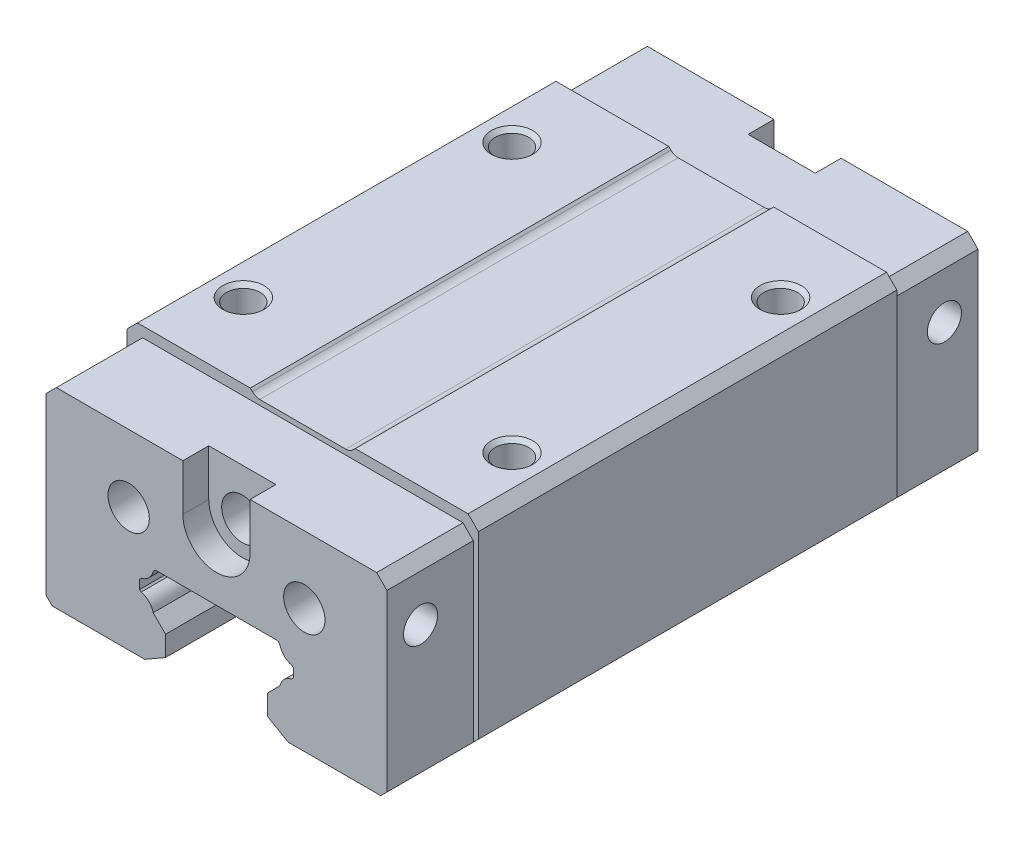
ISO-10303-21;
HEADER;
FILE_DESCRIPTION(('STEP AP214'),'2;1');
FILE_NAME('part.step','',(''),(''),'','','');
FILE_SCHEMA(('AUTOMOTIVE_DESIGN { 1 0 10303 214 1 1 1 1 }'));
ENDSEC;
DATA;
#1=APPLICATION_CONTEXT('core data for automotive mechanical design processes');
#2=APPLICATION_PROTOCOL_DEFINITION('international standard','automotive_design',2000,#1);
#3=PRODUCT_CONTEXT('',#1,'mechanical');
#4=PRODUCT('Part','Part','',(#3));
#5=PRODUCT_RELATED_PRODUCT_CATEGORY('part','',(#4));
#6=PRODUCT_DEFINITION_FORMATION('','',#4);
#7=PRODUCT_DEFINITION_CONTEXT('part definition',#1,'design');
#8=PRODUCT_DEFINITION('design','',#6,#7);
#9=PRODUCT_DEFINITION_SHAPE('','',#8);
#10=(LENGTH_UNIT() NAMED_UNIT(*) SI_UNIT(.MILLI.,.METRE.));
#11=(NAMED_UNIT(*) PLANE_ANGLE_UNIT() SI_UNIT($,.RADIAN.));
#12=(NAMED_UNIT(*) SI_UNIT($,.STERADIAN.) SOLID_ANGLE_UNIT());
#13=UNCERTAINTY_MEASURE_WITH_UNIT(LENGTH_MEASURE(1.E-05),#10,'distance_accuracy_value','');
#14=(GEOMETRIC_REPRESENTATION_CONTEXT(3) GLOBAL_UNCERTAINTY_ASSIGNED_CONTEXT((#13)) GLOBAL_UNIT_ASSIGNED_CONTEXT((#10,
#11,#12)) REPRESENTATION_CONTEXT('',''));
#15=CARTESIAN_POINT('',(0.,0.,0.));
#16=DIRECTION('',(0.,0.,1.));
#17=DIRECTION('',(1.,0.,0.));
#18=AXIS2_PLACEMENT_3D('',#15,#16,#17);
#19=CARTESIAN_POINT('',(-16.5000002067,-19.5,-57.2));
#20=DIRECTION('',(0.,0.,-1.));
#21=DIRECTION('',(0.,1.,0.));
#22=AXIS2_PLACEMENT_3D('',#19,#20,#21);
#23=PLANE('',#22);
#24=DIRECTION('',(-8.27225491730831E-08,-0.999999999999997,0.));
#25=VECTOR('',#24,1.);
#26=CARTESIAN_POINT('',(-3.25000007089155,-0.999999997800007,-57.2));
#27=LINE('',#26,#25);
#28=CARTESIAN_POINT('',(-3.25000007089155,-0.999999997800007,-57.2));
#29=VERTEX_POINT('',#28);
#30=CARTESIAN_POINT('',(-3.250000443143,-5.4999997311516,-57.2));
#31=VERTEX_POINT('',#30);
#32=EDGE_CURVE('E387',#29,#31,#27,.T.);
#33=ORIENTED_EDGE('',*,*,#32,.T.);
#34=CARTESIAN_POINT('',(-4.43143000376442E-07,-5.4999999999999,-57.2));
#35=DIRECTION('',(0.,0.,1.));
#36=DIRECTION('',(-0.999999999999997,8.27225541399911E-08,0.));
#37=AXIS2_PLACEMENT_3D('',#34,#35,#36);
#38=CIRCLE('',#37,3.25);
#39=CARTESIAN_POINT('',(3.24999955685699,-5.5000002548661,-57.2));
#40=VERTEX_POINT('',#39);
#41=EDGE_CURVE('E375',#31,#40,#38,.T.);
#42=ORIENTED_EDGE('',*,*,#41,.T.);
#43=DIRECTION('',(7.84203598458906E-08,0.999999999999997,0.));
#44=VECTOR('',#43,1.);
#45=CARTESIAN_POINT('',(3.249999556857,-5.5000002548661,-57.2));
#46=LINE('',#45,#44);
#47=CARTESIAN_POINT('',(3.24999990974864,-0.999999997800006,-57.2));
#48=VERTEX_POINT('',#47);
#49=EDGE_CURVE('E386',#40,#48,#46,.T.);
#50=ORIENTED_EDGE('',*,*,#49,.T.);
#51=DIRECTION('',(1.,0.,0.));
#52=VECTOR('',#51,1.);
#53=CARTESIAN_POINT('',(3.24999990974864,-0.9999999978,-57.2));
#54=LINE('',#53,#52);
#55=CARTESIAN_POINT('',(15.4999997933,-0.9999999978,-57.2));
#56=VERTEX_POINT('',#55);
#57=EDGE_CURVE('E408',#56,#48,#54,.F.);
#58=ORIENTED_EDGE('',*,*,#57,.F.);
#59=DIRECTION('',(0.707106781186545,-0.70710678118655,0.));
#60=VECTOR('',#59,1.);
#61=CARTESIAN_POINT('',(15.4999997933,-0.9999999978,-57.2));
#62=LINE('',#61,#60);
#63=CARTESIAN_POINT('',(16.4999997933,-1.9999999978,-57.2));
#64=VERTEX_POINT('',#63);
#65=EDGE_CURVE('E413',#64,#56,#62,.F.);
#66=ORIENTED_EDGE('',*,*,#65,.F.);
#67=DIRECTION('',(0.,-1.,0.));
#68=VECTOR('',#67,1.);
#69=CARTESIAN_POINT('',(16.4999997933,-1.9999999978,-57.2));
#70=LINE('',#69,#68);
#71=CARTESIAN_POINT('',(16.4999997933,-18.8999999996,-57.2));
#72=VERTEX_POINT('',#71);
#73=EDGE_CURVE('E417',#72,#64,#70,.F.);
#74=ORIENTED_EDGE('',*,*,#73,.F.);
#75=DIRECTION('',(-0.707106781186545,-0.70710678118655,0.));
#76=VECTOR('',#75,1.);
#77=CARTESIAN_POINT('',(16.4999997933,-18.8999999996,-57.2));
#78=LINE('',#77,#76);
#79=CARTESIAN_POINT('',(15.8999997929,-19.5,-57.2));
#80=VERTEX_POINT('',#79);
#81=EDGE_CURVE('E421',#80,#72,#78,.F.);
#82=ORIENTED_EDGE('',*,*,#81,.F.);
#83=DIRECTION('',(-1.,0.,0.));
#84=VECTOR('',#83,1.);
#85=CARTESIAN_POINT('',(15.8999997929,-19.5,-57.2));
#86=LINE('',#85,#84);
#87=CARTESIAN_POINT('',(6.9411533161,-19.5,-57.2));
#88=VERTEX_POINT('',#87);
#89=EDGE_CURVE('E426',#88,#80,#86,.F.);
#90=ORIENTED_EDGE('',*,*,#89,.F.);
#91=DIRECTION('',(-0.866025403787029,0.499999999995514,0.));
#92=VECTOR('',#91,1.);
#93=CARTESIAN_POINT('',(6.9411533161,-19.5,-57.2));
#94=LINE('',#93,#92);
#95=CARTESIAN_POINT('',(4.9299990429,-18.338859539,-57.2));
#96=VERTEX_POINT('',#95);
#97=EDGE_CURVE('E430',#96,#88,#94,.F.);
#98=ORIENTED_EDGE('',*,*,#97,.F.);
#99=DIRECTION('',(0.,1.,0.));
#100=VECTOR('',#99,1.);
#101=CARTESIAN_POINT('',(4.9299990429,-18.338859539,-57.2));
#102=LINE('',#101,#100);
#103=CARTESIAN_POINT('',(4.9299990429,-16.3860808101,-57.2));
#104=VERTEX_POINT('',#103);
#105=EDGE_CURVE('E435',#104,#96,#102,.F.);
#106=ORIENTED_EDGE('',*,*,#105,.F.);
#107=DIRECTION('',(0.7071067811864,0.707106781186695,0.));
#108=VECTOR('',#107,1.);
#109=CARTESIAN_POINT('',(4.9299990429,-16.3860808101,-57.2));
#110=LINE('',#109,#108);
#111=CARTESIAN_POINT('',(6.1305877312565,-15.185492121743,-57.2));
#112=VERTEX_POINT('',#111);
#113=EDGE_CURVE('E440',#112,#104,#110,.F.);
#114=ORIENTED_EDGE('',*,*,#113,.F.);
#115=CARTESIAN_POINT('',(7.63959702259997,-15.5395979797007,-57.2));
#116=DIRECTION('',(0.,0.,-1.));
#117=DIRECTION('',(-0.973554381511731,0.228455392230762,0.));
#118=AXIS2_PLACEMENT_3D('',#115,#116,#117);
#119=CIRCLE('',#118,1.55000000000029);
#120=CARTESIAN_POINT('',(7.2854911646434,-14.030588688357,-57.2));
#121=VERTEX_POINT('',#120);
#122=EDGE_CURVE('E445',#121,#112,#119,.F.);
#123=ORIENTED_EDGE('',*,*,#122,.F.);
#124=DIRECTION('',(0.70710678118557,0.707106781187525,0.));
#125=VECTOR('',#124,1.);
#126=CARTESIAN_POINT('',(7.2854911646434,-14.030588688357,-57.2));
#127=LINE('',#126,#125);
#128=CARTESIAN_POINT('',(7.4299990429,-13.8860808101,-57.2));
#129=VERTEX_POINT('',#128);
#130=EDGE_CURVE('E450',#129,#121,#127,.F.);
#131=ORIENTED_EDGE('',*,*,#130,.F.);
#132=DIRECTION('',(0.,1.,0.));
#133=VECTOR('',#132,1.);
#134=CARTESIAN_POINT('',(7.4299990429,-13.8860808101,-57.2));
#135=LINE('',#134,#133);
#136=CARTESIAN_POINT('',(7.4299990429,-13.0139191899,-57.2));
#137=VERTEX_POINT('',#136);
#138=EDGE_CURVE('E455',#137,#129,#135,.F.);
#139=ORIENTED_EDGE('',*,*,#138,.F.);
#140=DIRECTION('',(-0.707106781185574,0.707106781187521,0.));
#141=VECTOR('',#140,1.);
#142=CARTESIAN_POINT('',(7.4299990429,-13.0139191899,-57.2));
#143=LINE('',#142,#141);
#144=CARTESIAN_POINT('',(7.2854911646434,-12.869411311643,-57.2));
#145=VERTEX_POINT('',#144);
#146=EDGE_CURVE('E460',#145,#137,#143,.F.);
#147=ORIENTED_EDGE('',*,*,#146,.F.);
#148=CARTESIAN_POINT('',(7.63959702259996,-11.3604020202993,-57.2));
#149=DIRECTION('',(0.,0.,-1.));
#150=DIRECTION('',(-0.228455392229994,-0.973554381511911,0.));
#151=AXIS2_PLACEMENT_3D('',#148,#149,#150);
#152=CIRCLE('',#151,1.55000000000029);
#153=CARTESIAN_POINT('',(6.1305877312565,-11.714507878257,-57.2));
#154=VERTEX_POINT('',#153);
#155=EDGE_CURVE('E465',#154,#145,#152,.F.);
#156=ORIENTED_EDGE('',*,*,#155,.F.);
#157=DIRECTION('',(-0.707106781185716,0.707106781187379,0.));
#158=VECTOR('',#157,1.);
#159=CARTESIAN_POINT('',(6.1305877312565,-11.714507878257,-57.2));
#160=LINE('',#159,#158);
#161=CARTESIAN_POINT('',(5.916079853,-11.5,-57.2));
#162=VERTEX_POINT('',#161);
#163=EDGE_CURVE('E470',#162,#154,#160,.F.);
#164=ORIENTED_EDGE('',*,*,#163,.F.);
#165=DIRECTION('',(-1.,0.,0.));
#166=VECTOR('',#165,1.);
#167=CARTESIAN_POINT('',(5.916079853,-11.5,-57.2));
#168=LINE('',#167,#166);
#169=CARTESIAN_POINT('',(-5.9160802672,-11.5,-57.2));
#170=VERTEX_POINT('',#169);
#171=EDGE_CURVE('E475',#170,#162,#168,.F.);
#172=ORIENTED_EDGE('',*,*,#171,.F.);
#173=DIRECTION('',(-0.707106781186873,-0.707106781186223,0.));
#174=VECTOR('',#173,1.);
#175=CARTESIAN_POINT('',(-5.9160802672,-11.5,-57.2));
#176=LINE('',#175,#174);
#177=CARTESIAN_POINT('',(-6.1305881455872,-11.714507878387,-57.2));
#178=VERTEX_POINT('',#177);
#179=EDGE_CURVE('E480',#178,#170,#176,.F.);
#180=ORIENTED_EDGE('',*,*,#179,.F.);
#181=CARTESIAN_POINT('',(-7.63959743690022,-11.3604020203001,-57.2));
#182=DIRECTION('',(0.,0.,-1.));
#183=DIRECTION('',(0.973554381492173,-0.228455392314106,0.));
#184=AXIS2_PLACEMENT_3D('',#181,#182,#183);
#185=CIRCLE('',#184,1.55000000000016);
#186=CARTESIAN_POINT('',(-7.2854915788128,-12.869411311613,-57.2));
#187=VERTEX_POINT('',#186);
#188=EDGE_CURVE('E485',#187,#178,#185,.F.);
#189=ORIENTED_EDGE('',*,*,#188,.F.);
#190=DIRECTION('',(-0.707106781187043,-0.707106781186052,0.));
#191=VECTOR('',#190,1.);
#192=CARTESIAN_POINT('',(-7.2854915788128,-12.869411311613,-57.2));
#193=LINE('',#192,#191);
#194=CARTESIAN_POINT('',(-7.4299994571,-13.0139191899,-57.2));
#195=VERTEX_POINT('',#194);
#196=EDGE_CURVE('E490',#195,#187,#193,.F.);
#197=ORIENTED_EDGE('',*,*,#196,.F.);
#198=DIRECTION('',(0.,-1.,0.));
#199=VECTOR('',#198,1.);
#200=CARTESIAN_POINT('',(-7.4299994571,-13.0139191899,-57.2));
#201=LINE('',#200,#199);
#202=CARTESIAN_POINT('',(-7.4299994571,-13.8860808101,-57.2));
#203=VERTEX_POINT('',#202);
#204=EDGE_CURVE('E495',#203,#195,#201,.F.);
#205=ORIENTED_EDGE('',*,*,#204,.F.);
#206=DIRECTION('',(0.70710678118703,-0.707106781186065,0.));
#207=VECTOR('',#206,1.);
#208=CARTESIAN_POINT('',(-7.4299994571,-13.8860808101,-57.2));
#209=LINE('',#208,#207);
#210=CARTESIAN_POINT('',(-7.2854915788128,-14.030588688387,-57.2));
#211=VERTEX_POINT('',#210);
#212=EDGE_CURVE('E500',#211,#203,#209,.F.);
#213=ORIENTED_EDGE('',*,*,#212,.F.);
#214=CARTESIAN_POINT('',(-7.63959743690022,-15.5395979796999,-57.2));
#215=DIRECTION('',(0.,0.,-1.));
#216=DIRECTION('',(0.228455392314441,0.973554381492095,0.));
#217=AXIS2_PLACEMENT_3D('',#214,#215,#216);
#218=CIRCLE('',#217,1.55000000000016);
#219=CARTESIAN_POINT('',(-6.1305881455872,-15.185492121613,-57.2));
#220=VERTEX_POINT('',#219);
#221=EDGE_CURVE('E505',#220,#211,#218,.F.);
#222=ORIENTED_EDGE('',*,*,#221,.F.);
#223=DIRECTION('',(0.707106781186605,-0.70710678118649,0.));
#224=VECTOR('',#223,1.);
#225=CARTESIAN_POINT('',(-6.1305881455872,-15.185492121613,-57.2));
#226=LINE('',#225,#224);
#227=CARTESIAN_POINT('',(-4.9299994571,-16.3860808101,-57.2));
#228=VERTEX_POINT('',#227);
#229=EDGE_CURVE('E510',#228,#220,#226,.F.);
#230=ORIENTED_EDGE('',*,*,#229,.F.);
#231=DIRECTION('',(0.,-1.,0.));
#232=VECTOR('',#231,1.);
#233=CARTESIAN_POINT('',(-4.9299994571,-16.3860808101,-57.2));
#234=LINE('',#233,#232);
#235=CARTESIAN_POINT('',(-4.9299994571,-18.338859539,-57.2));
#236=VERTEX_POINT('',#235);
#237=EDGE_CURVE('E515',#236,#228,#234,.F.);
#238=ORIENTED_EDGE('',*,*,#237,.F.);
#239=DIRECTION('',(-0.866025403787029,-0.499999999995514,0.));
#240=VECTOR('',#239,1.);
#241=CARTESIAN_POINT('',(-4.9299994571,-18.338859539,-57.2));
#242=LINE('',#241,#240);
#243=CARTESIAN_POINT('',(-6.9411537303,-19.5,-57.2));
#244=VERTEX_POINT('',#243);
#245=EDGE_CURVE('E520',#244,#236,#242,.F.);
#246=ORIENTED_EDGE('',*,*,#245,.F.);
#247=DIRECTION('',(-1.,0.,0.));
#248=VECTOR('',#247,1.);
#249=CARTESIAN_POINT('',(-6.9411537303,-19.5,-57.2));
#250=LINE('',#249,#248);
#251=CARTESIAN_POINT('',(-15.9000002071,-19.5,-57.2));
#252=VERTEX_POINT('',#251);
#253=EDGE_CURVE('E525',#252,#244,#250,.F.);
#254=ORIENTED_EDGE('',*,*,#253,.F.);
#255=DIRECTION('',(-0.707106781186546,0.707106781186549,0.));
#256=VECTOR('',#255,1.);
#257=CARTESIAN_POINT('',(-15.9000002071,-19.5,-57.2));
#258=LINE('',#257,#256);
#259=CARTESIAN_POINT('',(-16.5000002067,-18.9000000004,-57.2));
#260=VERTEX_POINT('',#259);
#261=EDGE_CURVE('E530',#260,#252,#258,.F.);
#262=ORIENTED_EDGE('',*,*,#261,.F.);
#263=DIRECTION('',(0.,1.,0.));
#264=VECTOR('',#263,1.);
#265=CARTESIAN_POINT('',(-16.5000002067,-18.9000000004,-57.2));
#266=LINE('',#265,#264);
#267=CARTESIAN_POINT('',(-16.5000002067,-1.9999999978,-57.2));
#268=VERTEX_POINT('',#267);
#269=EDGE_CURVE('E535',#268,#260,#266,.F.);
#270=ORIENTED_EDGE('',*,*,#269,.F.);
#271=DIRECTION('',(0.707106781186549,0.707106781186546,0.));
#272=VECTOR('',#271,1.);
#273=CARTESIAN_POINT('',(-16.5000002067,-1.9999999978,-57.2));
#274=LINE('',#273,#272);
#275=CARTESIAN_POINT('',(-15.5000002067,-0.9999999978,-57.2));
#276=VERTEX_POINT('',#275);
#277=EDGE_CURVE('E539',#276,#268,#274,.F.);
#278=ORIENTED_EDGE('',*,*,#277,.F.);
#279=DIRECTION('',(1.,0.,0.));
#280=VECTOR('',#279,1.);
#281=CARTESIAN_POINT('',(-15.5000002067,-0.9999999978,-57.2));
#282=LINE('',#281,#280);
#283=EDGE_CURVE('E400',#29,#276,#282,.F.);
#284=ORIENTED_EDGE('',*,*,#283,.F.);
#285=EDGE_LOOP('',(#33,#42,#50,#58,#66,#74,#82,#90,#98,#106,#114,#123,#131,#139,#147,#156,#164,
#172,#180,#189,#197,#205,#213,#222,#230,#238,#246,#254,#262,#270,#278,#284));
#286=FACE_BOUND('',#285,.T.);
#287=CARTESIAN_POINT('',(8.499999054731,-7.5,-57.2));
#288=DIRECTION('',(0.,0.,1.));
#289=DIRECTION('',(-0.99999999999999,-1.42053911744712E-07,0.));
#290=AXIS2_PLACEMENT_3D('',#287,#288,#289);
#291=CIRCLE('',#290,2.);
#292=CARTESIAN_POINT('',(6.49999905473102,-7.50000028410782,-57.2));
#293=VERTEX_POINT('',#292);
#294=EDGE_CURVE('E547',#293,#293,#291,.T.);
#295=ORIENTED_EDGE('',*,*,#294,.T.);
#296=EDGE_LOOP('',(#295));
#297=FACE_BOUND('',#296,.T.);
#298=CARTESIAN_POINT('',(-8.499999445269,-7.5,-57.2));
#299=DIRECTION('',(0.,0.,1.));
#300=DIRECTION('',(-0.99999999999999,-1.42053861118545E-07,0.));
#301=AXIS2_PLACEMENT_3D('',#298,#299,#300);
#302=CIRCLE('',#301,2.);
#303=CARTESIAN_POINT('',(-10.499999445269,-7.50000028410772,-57.2));
#304=VERTEX_POINT('',#303);
#305=EDGE_CURVE('E552',#304,#304,#302,.T.);
#306=ORIENTED_EDGE('',*,*,#305,.T.);
#307=EDGE_LOOP('',(#306));
#308=FACE_BOUND('',#307,.T.);
#309=ADVANCED_FACE('F17',(#286,#297,#308),#23,.T.);
#310=CARTESIAN_POINT('',(-15.5000002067,-0.9999999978,-48.85));
#311=DIRECTION('',(0.,1.,0.));
#312=DIRECTION('',(1.,0.,0.));
#313=AXIS2_PLACEMENT_3D('',#310,#311,#312);
#314=PLANE('',#313);
#315=DIRECTION('',(7.77655166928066E-08,0.,-0.999999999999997));
#316=VECTOR('',#315,1.);
#317=CARTESIAN_POINT('',(-3.25000026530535,-0.9999999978,-54.7));
#318=LINE('',#317,#316);
#319=CARTESIAN_POINT('',(-3.25000026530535,-0.9999999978,-54.7));
#320=VERTEX_POINT('',#319);
#321=EDGE_CURVE('E555',#29,#320,#318,.F.);
#322=ORIENTED_EDGE('',*,*,#321,.F.);
#323=ORIENTED_EDGE('',*,*,#283,.T.);
#324=DIRECTION('',(0.,0.,1.));
#325=VECTOR('',#324,1.);
#326=CARTESIAN_POINT('',(-15.5000002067,-0.9999999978,-57.2));
#327=LINE('',#326,#325);
#328=CARTESIAN_POINT('',(-15.5000002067,-0.9999999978,-48.85));
#329=VERTEX_POINT('',#328);
#330=EDGE_CURVE('E557',#329,#276,#327,.F.);
#331=ORIENTED_EDGE('',*,*,#330,.F.);
#332=DIRECTION('',(1.,0.,0.));
#333=VECTOR('',#332,1.);
#334=CARTESIAN_POINT('',(-15.5000002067,-0.9999999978,-48.85));
#335=LINE('',#334,#333);
#336=CARTESIAN_POINT('',(15.4999997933,-0.9999999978,-48.85));
#337=VERTEX_POINT('',#336);
#338=EDGE_CURVE('E561',#337,#329,#335,.F.);
#339=ORIENTED_EDGE('',*,*,#338,.F.);
#340=DIRECTION('',(0.,0.,-1.));
#341=VECTOR('',#340,1.);
#342=CARTESIAN_POINT('',(15.4999997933,-0.9999999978,-48.85));
#343=LINE('',#342,#341);
#344=EDGE_CURVE('E565',#337,#56,#343,.T.);
#345=ORIENTED_EDGE('',*,*,#344,.T.);
#346=ORIENTED_EDGE('',*,*,#57,.T.);
#347=DIRECTION('',(0.,0.,1.));
#348=VECTOR('',#347,1.);
#349=CARTESIAN_POINT('',(3.24999990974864,-0.9999999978,-57.2));
#350=LINE('',#349,#348);
#351=CARTESIAN_POINT('',(3.24999990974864,-0.9999999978,-54.7));
#352=VERTEX_POINT('',#351);
#353=EDGE_CURVE('E570',#352,#48,#350,.F.);
#354=ORIENTED_EDGE('',*,*,#353,.F.);
#355=DIRECTION('',(-1.,0.,0.));
#356=VECTOR('',#355,1.);
#357=CARTESIAN_POINT('',(3.24999990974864,-0.9999999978,-54.7));
#358=LINE('',#357,#356);
#359=EDGE_CURVE('E574',#352,#320,#358,.T.);
#360=ORIENTED_EDGE('',*,*,#359,.T.);
#361=EDGE_LOOP('',(#322,#323,#331,#339,#345,#346,#354,#360));
#362=FACE_BOUND('',#361,.T.);
#363=ADVANCED_FACE('F1291',(#362),#314,.T.);
#364=CARTESIAN_POINT('',(-17.0000002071,-6.,-48.85));
#365=DIRECTION('',(-1.,0.,0.));
#366=DIRECTION('',(0.,0.,1.));
#367=AXIS2_PLACEMENT_3D('',#364,#365,#366);
#368=PLANE('',#367);
#369=DIRECTION('',(0.,-1.,0.));
#370=VECTOR('',#369,1.);
#371=CARTESIAN_POINT('',(-17.0000002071,-1.,-48.85));
#372=LINE('',#371,#370);
#373=CARTESIAN_POINT('',(-17.0000002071,-6.,-48.85));
#374=VERTEX_POINT('',#373);
#375=CARTESIAN_POINT('',(-17.0000002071,-1.,-48.85));
#376=VERTEX_POINT('',#375);
#377=EDGE_CURVE('E579',#374,#376,#372,.F.);
#378=ORIENTED_EDGE('',*,*,#377,.F.);
#379=DIRECTION('',(0.,0.,1.));
#380=VECTOR('',#379,1.);
#381=CARTESIAN_POINT('',(-17.0000002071,-6.,-48.85));
#382=LINE('',#381,#380);
#383=CARTESIAN_POINT('',(-17.0000002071,-6.,-8.34999999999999));
#384=VERTEX_POINT('',#383);
#385=EDGE_CURVE('E583',#374,#384,#382,.T.);
#386=ORIENTED_EDGE('',*,*,#385,.T.);
#387=DIRECTION('',(0.,1.,0.));
#388=VECTOR('',#387,1.);
#389=CARTESIAN_POINT('',(-17.0000002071,-6.,-8.34999999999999));
#390=LINE('',#389,#388);
#391=CARTESIAN_POINT('',(-17.0000002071,-1.,-8.34999999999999));
#392=VERTEX_POINT('',#391);
#393=EDGE_CURVE('E588',#384,#392,#390,.T.);
#394=ORIENTED_EDGE('',*,*,#393,.T.);
#395=DIRECTION('',(0.,0.,-1.));
#396=VECTOR('',#395,1.);
#397=CARTESIAN_POINT('',(-17.0000002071,-1.,-8.34999999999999));
#398=LINE('',#397,#396);
#399=EDGE_CURVE('E593',#376,#392,#398,.F.);
#400=ORIENTED_EDGE('',*,*,#399,.F.);
#401=EDGE_LOOP('',(#378,#386,#394,#400));
#402=FACE_BOUND('',#401,.T.);
#403=ADVANCED_FACE('F1296',(#402),#368,.T.);
#404=CARTESIAN_POINT('',(-17.0000002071,-6.,-48.85));
#405=DIRECTION('',(-0.707105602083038,-0.707107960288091,0.));
#406=DIRECTION('',(0.707107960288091,-0.707105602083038,0.));
#407=AXIS2_PLACEMENT_3D('',#404,#405,#406);
#408=PLANE('',#407);
#409=DIRECTION('',(0.707107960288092,-0.707105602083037,0.));
#410=VECTOR('',#409,1.);
#411=CARTESIAN_POINT('',(-17.0000002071,-6.,-48.85));
#412=LINE('',#411,#410);
#413=CARTESIAN_POINT('',(-16.7000002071,-6.2999989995,-48.85));
#414=VERTEX_POINT('',#413);
#415=EDGE_CURVE('E598',#414,#374,#412,.F.);
#416=ORIENTED_EDGE('',*,*,#415,.F.);
#417=DIRECTION('',(0.,0.,1.));
#418=VECTOR('',#417,1.);
#419=CARTESIAN_POINT('',(-16.7000002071,-6.2999989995,-48.85));
#420=LINE('',#419,#418);
#421=CARTESIAN_POINT('',(-16.7000002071,-6.2999989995,-8.34999999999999));
#422=VERTEX_POINT('',#421);
#423=EDGE_CURVE('E602',#414,#422,#420,.T.);
#424=ORIENTED_EDGE('',*,*,#423,.T.);
#425=DIRECTION('',(-0.707107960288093,0.707105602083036,0.));
#426=VECTOR('',#425,1.);
#427=CARTESIAN_POINT('',(-16.7000002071,-6.2999989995,-8.34999999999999));
#428=LINE('',#427,#426);
#429=EDGE_CURVE('E607',#422,#384,#428,.T.);
#430=ORIENTED_EDGE('',*,*,#429,.T.);
#431=ORIENTED_EDGE('',*,*,#385,.F.);
#432=EDGE_LOOP('',(#416,#424,#430,#431));
#433=FACE_BOUND('',#432,.T.);
#434=ADVANCED_FACE('F1302',(#433),#408,.T.);
#435=CARTESIAN_POINT('',(-16.7000002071,-18.7,-48.85));
#436=DIRECTION('',(-1.,0.,0.));
#437=DIRECTION('',(0.,0.,1.));
#438=AXIS2_PLACEMENT_3D('',#435,#436,#437);
#439=PLANE('',#438);
#440=DIRECTION('',(0.,-1.,0.));
#441=VECTOR('',#440,1.);
#442=CARTESIAN_POINT('',(-16.7000002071,-6.2999989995,-48.85));
#443=LINE('',#442,#441);
#444=CARTESIAN_POINT('',(-16.7000002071,-18.7,-48.85));
#445=VERTEX_POINT('',#444);
#446=EDGE_CURVE('E612',#445,#414,#443,.F.);
#447=ORIENTED_EDGE('',*,*,#446,.F.);
#448=DIRECTION('',(0.,0.,1.));
#449=VECTOR('',#448,1.);
#450=CARTESIAN_POINT('',(-16.7000002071,-18.7,-48.85));
#451=LINE('',#450,#449);
#452=CARTESIAN_POINT('',(-16.7000002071,-18.7,-8.34999999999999));
#453=VERTEX_POINT('',#452);
#454=EDGE_CURVE('E616',#445,#453,#451,.T.);
#455=ORIENTED_EDGE('',*,*,#454,.T.);
#456=DIRECTION('',(0.,1.,0.));
#457=VECTOR('',#456,1.);
#458=CARTESIAN_POINT('',(-16.7000002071,-18.7,-8.34999999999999));
#459=LINE('',#458,#457);
#460=EDGE_CURVE('E621',#453,#422,#459,.T.);
#461=ORIENTED_EDGE('',*,*,#460,.T.);
#462=ORIENTED_EDGE('',*,*,#423,.F.);
#463=EDGE_LOOP('',(#447,#455,#461,#462));
#464=FACE_BOUND('',#463,.T.);
#465=ADVANCED_FACE('F1306',(#464),#439,.T.);
#466=CARTESIAN_POINT('',(-16.7000002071,-18.7,-57.2));
#467=DIRECTION('',(-0.707106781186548,-0.707106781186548,0.));
#468=DIRECTION('',(0.707106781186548,-0.707106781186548,0.));
#469=AXIS2_PLACEMENT_3D('',#466,#467,#468);
#470=PLANE('',#469);
#471=DIRECTION('',(0.707106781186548,-0.707106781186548,0.));
#472=VECTOR('',#471,1.);
#473=CARTESIAN_POINT('',(-16.7000002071,-18.7,-48.85));
#474=LINE('',#473,#472);
#475=CARTESIAN_POINT('',(-16.5000002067,-18.9000000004,-48.85));
#476=VERTEX_POINT('',#475);
#477=EDGE_CURVE('E626',#476,#445,#474,.F.);
#478=ORIENTED_EDGE('',*,*,#477,.F.);
#479=DIRECTION('',(0.,0.,-1.));
#480=VECTOR('',#479,1.);
#481=CARTESIAN_POINT('',(-16.5000002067,-18.9000000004,-48.85));
#482=LINE('',#481,#480);
#483=EDGE_CURVE('E630',#476,#260,#482,.T.);
#484=ORIENTED_EDGE('',*,*,#483,.T.);
#485=ORIENTED_EDGE('',*,*,#261,.T.);
#486=DIRECTION('',(0.,0.,1.));
#487=VECTOR('',#486,1.);
#488=CARTESIAN_POINT('',(-15.9000002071,-19.5,-57.2));
#489=LINE('',#488,#487);
#490=CARTESIAN_POINT('',(-15.9000002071,-19.5,0.));
#491=VERTEX_POINT('',#490);
#492=EDGE_CURVE('E635',#252,#491,#489,.T.);
#493=ORIENTED_EDGE('',*,*,#492,.T.);
#494=DIRECTION('',(-0.707106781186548,0.707106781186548,0.));
#495=VECTOR('',#494,1.);
#496=CARTESIAN_POINT('',(-15.9000002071,-19.5,0.));
#497=LINE('',#496,#495);
#498=CARTESIAN_POINT('',(-16.5000002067,-18.9000000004,0.));
#499=VERTEX_POINT('',#498);
#500=EDGE_CURVE('E640',#499,#491,#497,.F.);
#501=ORIENTED_EDGE('',*,*,#500,.F.);
#502=DIRECTION('',(0.,0.,-1.));
#503=VECTOR('',#502,1.);
#504=CARTESIAN_POINT('',(-16.5000002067,-18.9000000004,0.));
#505=LINE('',#504,#503);
#506=CARTESIAN_POINT('',(-16.5000002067,-18.9000000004,-8.35));
#507=VERTEX_POINT('',#506);
#508=EDGE_CURVE('E645',#507,#499,#505,.F.);
#509=ORIENTED_EDGE('',*,*,#508,.F.);
#510=DIRECTION('',(-0.707106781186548,0.707106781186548,0.));
#511=VECTOR('',#510,1.);
#512=CARTESIAN_POINT('',(-16.5000002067,-18.9000000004,-8.35));
#513=LINE('',#512,#511);
#514=EDGE_CURVE('E649',#507,#453,#513,.T.);
#515=ORIENTED_EDGE('',*,*,#514,.T.);
#516=ORIENTED_EDGE('',*,*,#454,.F.);
#517=EDGE_LOOP('',(#478,#484,#485,#493,#501,#509,#515,#516));
#518=FACE_BOUND('',#517,.T.);
#519=ADVANCED_FACE('F1310',(#518),#470,.T.);
#520=CARTESIAN_POINT('',(15.8999997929,-19.5,-57.2));
#521=DIRECTION('',(0.707106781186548,-0.707106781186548,0.));
#522=DIRECTION('',(0.707106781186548,0.707106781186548,0.));
#523=AXIS2_PLACEMENT_3D('',#520,#521,#522);
#524=PLANE('',#523);
#525=DIRECTION('',(0.70710678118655,0.707106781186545,0.));
#526=VECTOR('',#525,1.);
#527=CARTESIAN_POINT('',(16.4999997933,-18.8999999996,-48.85));
#528=LINE('',#527,#526);
#529=CARTESIAN_POINT('',(16.9999997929,-18.4,-48.85));
#530=VERTEX_POINT('',#529);
#531=CARTESIAN_POINT('',(16.4999997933,-18.8999999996,-48.85));
#532=VERTEX_POINT('',#531);
#533=EDGE_CURVE('E654',#530,#532,#528,.F.);
#534=ORIENTED_EDGE('',*,*,#533,.F.);
#535=DIRECTION('',(0.,0.,1.));
#536=VECTOR('',#535,1.);
#537=CARTESIAN_POINT('',(16.9999997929,-18.4,-48.85));
#538=LINE('',#537,#536);
#539=CARTESIAN_POINT('',(16.9999997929,-18.4,-8.34999999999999));
#540=VERTEX_POINT('',#539);
#541=EDGE_CURVE('E658',#530,#540,#538,.T.);
#542=ORIENTED_EDGE('',*,*,#541,.T.);
#543=DIRECTION('',(-0.707106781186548,-0.707106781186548,0.));
#544=VECTOR('',#543,1.);
#545=CARTESIAN_POINT('',(16.9999997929,-18.4,-8.34999999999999));
#546=LINE('',#545,#544);
#547=CARTESIAN_POINT('',(16.4999997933,-18.8999999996,-8.34999999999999));
#548=VERTEX_POINT('',#547);
#549=EDGE_CURVE('E663',#540,#548,#546,.T.);
#550=ORIENTED_EDGE('',*,*,#549,.T.);
#551=DIRECTION('',(0.,0.,1.));
#552=VECTOR('',#551,1.);
#553=CARTESIAN_POINT('',(16.4999997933,-18.8999999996,-8.34999999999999));
#554=LINE('',#553,#552);
#555=CARTESIAN_POINT('',(16.4999997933,-18.8999999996,0.));
#556=VERTEX_POINT('',#555);
#557=EDGE_CURVE('E668',#548,#556,#554,.T.);
#558=ORIENTED_EDGE('',*,*,#557,.T.);
#559=DIRECTION('',(-0.707106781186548,-0.707106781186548,0.));
#560=VECTOR('',#559,1.);
#561=CARTESIAN_POINT('',(16.4999997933,-18.8999999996,0.));
#562=LINE('',#561,#560);
#563=CARTESIAN_POINT('',(15.8999997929,-19.5,0.));
#564=VERTEX_POINT('',#563);
#565=EDGE_CURVE('E673',#564,#556,#562,.F.);
#566=ORIENTED_EDGE('',*,*,#565,.F.);
#567=DIRECTION('',(0.,0.,-1.));
#568=VECTOR('',#567,1.);
#569=CARTESIAN_POINT('',(15.8999997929,-19.5,0.));
#570=LINE('',#569,#568);
#571=EDGE_CURVE('E678',#80,#564,#570,.F.);
#572=ORIENTED_EDGE('',*,*,#571,.F.);
#573=ORIENTED_EDGE('',*,*,#81,.T.);
#574=DIRECTION('',(0.,0.,1.));
#575=VECTOR('',#574,1.);
#576=CARTESIAN_POINT('',(16.4999997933,-18.8999999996,-57.2));
#577=LINE('',#576,#575);
#578=EDGE_CURVE('E682',#532,#72,#577,.F.);
#579=ORIENTED_EDGE('',*,*,#578,.F.);
#580=EDGE_LOOP('',(#534,#542,#550,#558,#566,#572,#573,#579));
#581=FACE_BOUND('',#580,.T.);
#582=ADVANCED_FACE('F1314',(#581),#524,.T.);
#583=CARTESIAN_POINT('',(16.9999997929,-18.4,-8.35));
#584=DIRECTION('',(1.,0.,0.));
#585=DIRECTION('',(0.,0.,-1.));
#586=AXIS2_PLACEMENT_3D('',#583,#584,#585);
#587=PLANE('',#586);
#588=DIRECTION('',(0.,1.,0.));
#589=VECTOR('',#588,1.);
#590=CARTESIAN_POINT('',(16.9999997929,-18.4,-48.85));
#591=LINE('',#590,#589);
#592=CARTESIAN_POINT('',(16.9999997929,-0.999999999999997,-48.85));
#593=VERTEX_POINT('',#592);
#594=EDGE_CURVE('E686',#593,#530,#591,.F.);
#595=ORIENTED_EDGE('',*,*,#594,.F.);
#596=DIRECTION('',(0.,0.,1.));
#597=VECTOR('',#596,1.);
#598=CARTESIAN_POINT('',(16.9999997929,-0.999999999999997,-48.85));
#599=LINE('',#598,#597);
#600=CARTESIAN_POINT('',(16.9999997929,-0.999999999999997,-8.35));
#601=VERTEX_POINT('',#600);
#602=EDGE_CURVE('E690',#593,#601,#599,.T.);
#603=ORIENTED_EDGE('',*,*,#602,.T.);
#604=DIRECTION('',(0.,-1.,0.));
#605=VECTOR('',#604,1.);
#606=CARTESIAN_POINT('',(16.9999997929,-0.999999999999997,-8.35));
#607=LINE('',#606,#605);
#608=EDGE_CURVE('E695',#601,#540,#607,.T.);
#609=ORIENTED_EDGE('',*,*,#608,.T.);
#610=ORIENTED_EDGE('',*,*,#541,.F.);
#611=EDGE_LOOP('',(#595,#603,#609,#610));
#612=FACE_BOUND('',#611,.T.);
#613=ADVANCED_FACE('F1318',(#612),#587,.T.);
#614=CARTESIAN_POINT('',(16.9999997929,-1.,-48.85));
#615=DIRECTION('',(0.707106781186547,0.707106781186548,0.));
#616=DIRECTION('',(-0.707106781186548,0.707106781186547,0.));
#617=AXIS2_PLACEMENT_3D('',#614,#615,#616);
#618=PLANE('',#617);
#619=DIRECTION('',(-0.707106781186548,0.707106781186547,0.));
#620=VECTOR('',#619,1.);
#621=CARTESIAN_POINT('',(16.9999997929,-1.,-48.85));
#622=LINE('',#621,#620);
#623=CARTESIAN_POINT('',(15.9999997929,0.,-48.85));
#624=VERTEX_POINT('',#623);
#625=EDGE_CURVE('E700',#624,#593,#622,.F.);
#626=ORIENTED_EDGE('',*,*,#625,.F.);
#627=DIRECTION('',(0.,0.,1.));
#628=VECTOR('',#627,1.);
#629=CARTESIAN_POINT('',(15.9999997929,0.,-48.85));
#630=LINE('',#629,#628);
#631=CARTESIAN_POINT('',(15.9999997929,0.,-8.34999999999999));
#632=VERTEX_POINT('',#631);
#633=EDGE_CURVE('E704',#624,#632,#630,.T.);
#634=ORIENTED_EDGE('',*,*,#633,.T.);
#635=DIRECTION('',(0.707106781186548,-0.707106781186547,0.));
#636=VECTOR('',#635,1.);
#637=CARTESIAN_POINT('',(15.9999997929,0.,-8.34999999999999));
#638=LINE('',#637,#636);
#639=EDGE_CURVE('E709',#632,#601,#638,.T.);
#640=ORIENTED_EDGE('',*,*,#639,.T.);
#641=ORIENTED_EDGE('',*,*,#602,.F.);
#642=EDGE_LOOP('',(#626,#634,#640,#641));
#643=FACE_BOUND('',#642,.T.);
#644=ADVANCED_FACE('F1322',(#643),#618,.T.);
#645=CARTESIAN_POINT('',(5.0757365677,0.,-48.85));
#646=DIRECTION('',(0.,1.,0.));
#647=DIRECTION('',(0.,0.,1.));
#648=AXIS2_PLACEMENT_3D('',#645,#646,#647);
#649=PLANE('',#648);
#650=DIRECTION('',(-1.,0.,0.));
#651=VECTOR('',#650,1.);
#652=CARTESIAN_POINT('',(15.9999997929,0.,-48.85));
#653=LINE('',#652,#651);
#654=CARTESIAN_POINT('',(5.0757365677,0.,-48.85));
#655=VERTEX_POINT('',#654);
#656=EDGE_CURVE('E714',#655,#624,#653,.F.);
#657=ORIENTED_EDGE('',*,*,#656,.F.);
#658=DIRECTION('',(0.,0.,1.));
#659=VECTOR('',#658,1.);
#660=CARTESIAN_POINT('',(5.0757365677,0.,-48.85));
#661=LINE('',#660,#659);
#662=CARTESIAN_POINT('',(5.0757365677,0.,-8.34999999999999));
#663=VERTEX_POINT('',#662);
#664=EDGE_CURVE('E718',#655,#663,#661,.T.);
#665=ORIENTED_EDGE('',*,*,#664,.T.);
#666=DIRECTION('',(1.,0.,0.));
#667=VECTOR('',#666,1.);
#668=CARTESIAN_POINT('',(5.0757365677,0.,-8.34999999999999));
#669=LINE('',#668,#667);
#670=EDGE_CURVE('E723',#663,#632,#669,.T.);
#671=ORIENTED_EDGE('',*,*,#670,.T.);
#672=ORIENTED_EDGE('',*,*,#633,.F.);
#673=EDGE_LOOP('',(#657,#665,#671,#672));
#674=FACE_BOUND('',#673,.T.);
#675=CARTESIAN_POINT('',(13.,0.,-15.6));
#676=DIRECTION('',(0.,-1.,0.));
#677=DIRECTION('',(0.,0.,1.));
#678=AXIS2_PLACEMENT_3D('',#675,#676,#677);
#679=CIRCLE('',#678,2.);
#680=CARTESIAN_POINT('',(13.,0.,-13.6));
#681=VERTEX_POINT('',#680);
#682=EDGE_CURVE('E728',#681,#681,#679,.T.);
#683=ORIENTED_EDGE('',*,*,#682,.T.);
#684=EDGE_LOOP('',(#683));
#685=FACE_BOUND('',#684,.T.);
#686=CARTESIAN_POINT('',(13.,0.,-41.6));
#687=DIRECTION('',(0.,-1.,0.));
#688=DIRECTION('',(0.,0.,1.));
#689=AXIS2_PLACEMENT_3D('',#686,#687,#688);
#690=CIRCLE('',#689,2.);
#691=CARTESIAN_POINT('',(13.,0.,-39.6));
#692=VERTEX_POINT('',#691);
#693=EDGE_CURVE('E733',#692,#692,#690,.T.);
#694=ORIENTED_EDGE('',*,*,#693,.T.);
#695=EDGE_LOOP('',(#694));
#696=FACE_BOUND('',#695,.T.);
#697=ADVANCED_FACE('F1326',(#674,#685,#696),#649,.T.);
#698=CARTESIAN_POINT('',(5.0757365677,0.,-48.85));
#699=DIRECTION('',(-0.707107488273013,0.707106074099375,0.));
#700=DIRECTION('',(-0.707106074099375,-0.707107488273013,0.));
#701=AXIS2_PLACEMENT_3D('',#698,#699,#700);
#702=PLANE('',#701);
#703=DIRECTION('',(-0.707106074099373,-0.707107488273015,0.));
#704=VECTOR('',#703,1.);
#705=CARTESIAN_POINT('',(5.0757365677,0.,-48.85));
#706=LINE('',#705,#704);
#707=CARTESIAN_POINT('',(4.8686309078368,-0.20710607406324,-48.85));
#708=VERTEX_POINT('',#707);
#709=EDGE_CURVE('E736',#708,#655,#706,.F.);
#710=ORIENTED_EDGE('',*,*,#709,.F.);
#711=DIRECTION('',(0.,0.,1.));
#712=VECTOR('',#711,1.);
#713=CARTESIAN_POINT('',(4.8686309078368,-0.20710607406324,-48.85));
#714=LINE('',#713,#712);
#715=CARTESIAN_POINT('',(4.8686309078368,-0.20710607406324,-8.34999999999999));
#716=VERTEX_POINT('',#715);
#717=EDGE_CURVE('E738',#708,#716,#714,.T.);
#718=ORIENTED_EDGE('',*,*,#717,.T.);
#719=DIRECTION('',(0.707106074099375,0.707107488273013,0.));
#720=VECTOR('',#719,1.);
#721=CARTESIAN_POINT('',(4.8686309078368,-0.20710607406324,-8.34999999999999));
#722=LINE('',#721,#720);
#723=EDGE_CURVE('E743',#716,#663,#722,.T.);
#724=ORIENTED_EDGE('',*,*,#723,.T.);
#725=ORIENTED_EDGE('',*,*,#664,.F.);
#726=EDGE_LOOP('',(#710,#718,#724,#725));
#727=FACE_BOUND('',#726,.T.);
#728=ADVANCED_FACE('F1330',(#727),#702,.T.);
#729=CARTESIAN_POINT('',(4.16152341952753,0.500000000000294,-57.2));
#730=DIRECTION('',(0.,0.,1.));
#731=DIRECTION('',(7.24689581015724E-11,-1.,0.));
#732=AXIS2_PLACEMENT_3D('',#729,#730,#731);
#733=CYLINDRICAL_SURFACE('',#732,1.00000000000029);
#734=ORIENTED_EDGE('',*,*,#717,.F.);
#735=CARTESIAN_POINT('',(4.16152341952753,0.500000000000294,-48.85));
#736=DIRECTION('',(0.,0.,-1.));
#737=DIRECTION('',(0.707107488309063,-0.707106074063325,0.));
#738=AXIS2_PLACEMENT_3D('',#735,#736,#737);
#739=CIRCLE('',#738,1.00000000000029);
#740=CARTESIAN_POINT('',(4.1615234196,-0.5,-48.85));
#741=VERTEX_POINT('',#740);
#742=EDGE_CURVE('E748',#708,#741,#739,.T.);
#743=ORIENTED_EDGE('',*,*,#742,.T.);
#744=DIRECTION('',(0.,0.,1.));
#745=VECTOR('',#744,1.);
#746=CARTESIAN_POINT('',(4.1615234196,-0.5,-48.85));
#747=LINE('',#746,#745);
#748=CARTESIAN_POINT('',(4.1615234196,-0.5,-8.34999999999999));
#749=VERTEX_POINT('',#748);
#750=EDGE_CURVE('E753',#741,#749,#747,.T.);
#751=ORIENTED_EDGE('',*,*,#750,.T.);
#752=CARTESIAN_POINT('',(4.16152341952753,0.500000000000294,-8.35));
#753=DIRECTION('',(0.,0.,1.));
#754=DIRECTION('',(7.2469141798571E-11,-1.,0.));
#755=AXIS2_PLACEMENT_3D('',#752,#753,#754);
#756=CIRCLE('',#755,1.00000000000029);
#757=EDGE_CURVE('E758',#716,#749,#756,.F.);
#758=ORIENTED_EDGE('',*,*,#757,.F.);
#759=EDGE_LOOP('',(#734,#743,#751,#758));
#760=FACE_BOUND('',#759,.T.);
#761=ADVANCED_FACE('F1334',(#760),#733,.F.);
#762=CARTESIAN_POINT('',(-4.16152383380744,-0.5,-48.85));
#763=DIRECTION('',(0.,1.,0.));
#764=DIRECTION('',(0.,0.,1.));
#765=AXIS2_PLACEMENT_3D('',#762,#763,#764);
#766=PLANE('',#765);
#767=DIRECTION('',(-1.,0.,0.));
#768=VECTOR('',#767,1.);
#769=CARTESIAN_POINT('',(4.1615234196,-0.5,-48.85));
#770=LINE('',#769,#768);
#771=CARTESIAN_POINT('',(-4.16152383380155,-0.5,-48.85));
#772=VERTEX_POINT('',#771);
#773=EDGE_CURVE('E762',#772,#741,#770,.F.);
#774=ORIENTED_EDGE('',*,*,#773,.F.);
#775=DIRECTION('',(-1.45485818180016E-13,0.,1.));
#776=VECTOR('',#775,1.);
#777=CARTESIAN_POINT('',(-4.16152383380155,-0.5,-48.85));
#778=LINE('',#777,#776);
#779=CARTESIAN_POINT('',(-4.16152383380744,-0.5,-8.34999999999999));
#780=VERTEX_POINT('',#779);
#781=EDGE_CURVE('E766',#772,#780,#778,.T.);
#782=ORIENTED_EDGE('',*,*,#781,.T.);
#783=DIRECTION('',(1.,0.,0.));
#784=VECTOR('',#783,1.);
#785=CARTESIAN_POINT('',(-4.16152383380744,-0.5,-8.34999999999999));
#786=LINE('',#785,#784);
#787=EDGE_CURVE('E771',#780,#749,#786,.T.);
#788=ORIENTED_EDGE('',*,*,#787,.T.);
#789=ORIENTED_EDGE('',*,*,#750,.F.);
#790=EDGE_LOOP('',(#774,#782,#788,#789));
#791=FACE_BOUND('',#790,.T.);
#792=ADVANCED_FACE('F1338',(#791),#766,.T.);
#793=CARTESIAN_POINT('',(-4.16152383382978,0.499999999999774,-57.2));
#794=DIRECTION('',(0.,0.,1.));
#795=DIRECTION('',(-0.707108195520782,-0.707105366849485,0.));
#796=AXIS2_PLACEMENT_3D('',#793,#794,#795);
#797=CYLINDRICAL_SURFACE('',#796,0.999999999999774);
#798=ORIENTED_EDGE('',*,*,#781,.F.);
#799=CARTESIAN_POINT('',(-4.16152383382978,0.499999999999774,-48.85));
#800=DIRECTION('',(0.,0.,-1.));
#801=DIRECTION('',(2.82271983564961E-11,-1.,0.));
#802=AXIS2_PLACEMENT_3D('',#799,#800,#801);
#803=CIRCLE('',#802,0.999999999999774);
#804=CARTESIAN_POINT('',(-4.8686320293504,-0.207105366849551,-48.85));
#805=VERTEX_POINT('',#804);
#806=EDGE_CURVE('E776',#772,#805,#803,.T.);
#807=ORIENTED_EDGE('',*,*,#806,.T.);
#808=DIRECTION('',(0.,0.,1.));
#809=VECTOR('',#808,1.);
#810=CARTESIAN_POINT('',(-4.8686320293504,-0.207105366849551,-48.85));
#811=LINE('',#810,#809);
#812=CARTESIAN_POINT('',(-4.8686320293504,-0.207105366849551,-8.35));
#813=VERTEX_POINT('',#812);
#814=EDGE_CURVE('E781',#805,#813,#811,.T.);
#815=ORIENTED_EDGE('',*,*,#814,.T.);
#816=CARTESIAN_POINT('',(-4.16152383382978,0.499999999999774,-8.35));
#817=DIRECTION('',(0.,0.,1.));
#818=DIRECTION('',(-0.707108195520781,-0.707105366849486,0.));
#819=AXIS2_PLACEMENT_3D('',#816,#817,#818);
#820=CIRCLE('',#819,0.999999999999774);
#821=EDGE_CURVE('E786',#780,#813,#820,.F.);
#822=ORIENTED_EDGE('',*,*,#821,.F.);
#823=EDGE_LOOP('',(#798,#807,#815,#822));
#824=FACE_BOUND('',#823,.T.);
#825=ADVANCED_FACE('F1342',(#824),#797,.F.);
#826=CARTESIAN_POINT('',(-4.8686320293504,-0.20710536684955,-48.85));
#827=DIRECTION('',(0.707108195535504,0.707105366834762,0.));
#828=DIRECTION('',(-0.707105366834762,0.707108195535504,0.));
#829=AXIS2_PLACEMENT_3D('',#826,#827,#828);
#830=PLANE('',#829);
#831=DIRECTION('',(-0.707105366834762,0.707108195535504,0.));
#832=VECTOR('',#831,1.);
#833=CARTESIAN_POINT('',(-4.8686320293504,-0.20710536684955,-48.85));
#834=LINE('',#833,#832);
#835=CARTESIAN_POINT('',(-5.0757365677,0.,-48.85));
#836=VERTEX_POINT('',#835);
#837=EDGE_CURVE('E790',#836,#805,#834,.F.);
#838=ORIENTED_EDGE('',*,*,#837,.F.);
#839=DIRECTION('',(0.,0.,1.));
#840=VECTOR('',#839,1.);
#841=CARTESIAN_POINT('',(-5.0757365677,0.,-48.85));
#842=LINE('',#841,#840);
#843=CARTESIAN_POINT('',(-5.0757365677,0.,-8.34999999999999));
#844=VERTEX_POINT('',#843);
#845=EDGE_CURVE('E794',#836,#844,#842,.T.);
#846=ORIENTED_EDGE('',*,*,#845,.T.);
#847=DIRECTION('',(0.707105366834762,-0.707108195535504,0.));
#848=VECTOR('',#847,1.);
#849=CARTESIAN_POINT('',(-5.0757365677,0.,-8.34999999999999));
#850=LINE('',#849,#848);
#851=EDGE_CURVE('E799',#844,#813,#850,.T.);
#852=ORIENTED_EDGE('',*,*,#851,.T.);
#853=ORIENTED_EDGE('',*,*,#814,.F.);
#854=EDGE_LOOP('',(#838,#846,#852,#853));
#855=FACE_BOUND('',#854,.T.);
#856=ADVANCED_FACE('F1346',(#855),#830,.T.);
#857=CARTESIAN_POINT('',(-16.0000002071,0.,-48.85));
#858=DIRECTION('',(0.,1.,0.));
#859=DIRECTION('',(0.,0.,1.));
#860=AXIS2_PLACEMENT_3D('',#857,#858,#859);
#861=PLANE('',#860);
#862=DIRECTION('',(-1.,0.,0.));
#863=VECTOR('',#862,1.);
#864=CARTESIAN_POINT('',(-5.0757365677,0.,-48.85));
#865=LINE('',#864,#863);
#866=CARTESIAN_POINT('',(-16.0000002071,0.,-48.85));
#867=VERTEX_POINT('',#866);
#868=EDGE_CURVE('E804',#867,#836,#865,.F.);
#869=ORIENTED_EDGE('',*,*,#868,.F.);
#870=DIRECTION('',(0.,0.,1.));
#871=VECTOR('',#870,1.);
#872=CARTESIAN_POINT('',(-16.0000002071,0.,-48.85));
#873=LINE('',#872,#871);
#874=CARTESIAN_POINT('',(-16.0000002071,0.,-8.34999999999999));
#875=VERTEX_POINT('',#874);
#876=EDGE_CURVE('E808',#867,#875,#873,.T.);
#877=ORIENTED_EDGE('',*,*,#876,.T.);
#878=DIRECTION('',(1.,0.,0.));
#879=VECTOR('',#878,1.);
#880=CARTESIAN_POINT('',(-16.0000002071,0.,-8.34999999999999));
#881=LINE('',#880,#879);
#882=EDGE_CURVE('E813',#875,#844,#881,.T.);
#883=ORIENTED_EDGE('',*,*,#882,.T.);
#884=ORIENTED_EDGE('',*,*,#845,.F.);
#885=EDGE_LOOP('',(#869,#877,#883,#884));
#886=FACE_BOUND('',#885,.T.);
#887=CARTESIAN_POINT('',(-13.,0.,-41.6));
#888=DIRECTION('',(0.,-1.,0.));
#889=DIRECTION('',(0.,0.,1.));
#890=AXIS2_PLACEMENT_3D('',#887,#888,#889);
#891=CIRCLE('',#890,2.);
#892=CARTESIAN_POINT('',(-13.,0.,-39.6));
#893=VERTEX_POINT('',#892);
#894=EDGE_CURVE('E818',#893,#893,#891,.T.);
#895=ORIENTED_EDGE('',*,*,#894,.T.);
#896=EDGE_LOOP('',(#895));
#897=FACE_BOUND('',#896,.T.);
#898=CARTESIAN_POINT('',(-13.,0.,-15.6));
#899=DIRECTION('',(0.,-1.,0.));
#900=DIRECTION('',(0.,0.,1.));
#901=AXIS2_PLACEMENT_3D('',#898,#899,#900);
#902=CIRCLE('',#901,2.);
#903=CARTESIAN_POINT('',(-13.,0.,-13.6));
#904=VERTEX_POINT('',#903);
#905=EDGE_CURVE('E823',#904,#904,#902,.T.);
#906=ORIENTED_EDGE('',*,*,#905,.T.);
#907=EDGE_LOOP('',(#906));
#908=FACE_BOUND('',#907,.T.);
#909=ADVANCED_FACE('F1350',(#886,#897,#908),#861,.T.);
#910=CARTESIAN_POINT('',(-16.0000002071,0.,-48.85));
#911=DIRECTION('',(-0.707106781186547,0.707106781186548,0.));
#912=DIRECTION('',(-0.707106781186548,-0.707106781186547,0.));
#913=AXIS2_PLACEMENT_3D('',#910,#911,#912);
#914=PLANE('',#913);
#915=DIRECTION('',(-0.707106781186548,-0.707106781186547,0.));
#916=VECTOR('',#915,1.);
#917=CARTESIAN_POINT('',(-16.0000002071,0.,-48.85));
#918=LINE('',#917,#916);
#919=EDGE_CURVE('E826',#376,#867,#918,.F.);
#920=ORIENTED_EDGE('',*,*,#919,.F.);
#921=ORIENTED_EDGE('',*,*,#399,.T.);
#922=DIRECTION('',(0.707106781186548,0.707106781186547,0.));
#923=VECTOR('',#922,1.);
#924=CARTESIAN_POINT('',(-17.0000002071,-0.999999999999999,-8.34999999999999));
#925=LINE('',#924,#923);
#926=EDGE_CURVE('E828',#392,#875,#925,.T.);
#927=ORIENTED_EDGE('',*,*,#926,.T.);
#928=ORIENTED_EDGE('',*,*,#876,.F.);
#929=EDGE_LOOP('',(#920,#921,#927,#928));
#930=FACE_BOUND('',#929,.T.);
#931=ADVANCED_FACE('F1354',(#930),#914,.T.);
#932=CARTESIAN_POINT('',(-16.5000002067,-19.5,0.));
#933=DIRECTION('',(0.,0.,1.));
#934=DIRECTION('',(1.,0.,0.));
#935=AXIS2_PLACEMENT_3D('',#932,#933,#934);
#936=PLANE('',#935);
#937=DIRECTION('',(8.27225491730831E-08,0.999999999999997,0.));
#938=VECTOR('',#937,1.);
#939=CARTESIAN_POINT('',(-3.250000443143,-5.4999997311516,0.));
#940=LINE('',#939,#938);
#941=CARTESIAN_POINT('',(-3.25000007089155,-0.999999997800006,0.));
#942=VERTEX_POINT('',#941);
#943=CARTESIAN_POINT('',(-3.250000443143,-5.4999997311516,0.));
#944=VERTEX_POINT('',#943);
#945=EDGE_CURVE('E833',#942,#944,#940,.F.);
#946=ORIENTED_EDGE('',*,*,#945,.F.);
#947=DIRECTION('',(-1.,0.,0.));
#948=VECTOR('',#947,1.);
#949=CARTESIAN_POINT('',(-3.25000007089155,-0.9999999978,0.));
#950=LINE('',#949,#948);
#951=CARTESIAN_POINT('',(-15.5000002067,-0.9999999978,0.));
#952=VERTEX_POINT('',#951);
#953=EDGE_CURVE('E838',#942,#952,#950,.T.);
#954=ORIENTED_EDGE('',*,*,#953,.T.);
#955=DIRECTION('',(-0.707106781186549,-0.707106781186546,0.));
#956=VECTOR('',#955,1.);
#957=CARTESIAN_POINT('',(-15.5000002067,-0.9999999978,0.));
#958=LINE('',#957,#956);
#959=CARTESIAN_POINT('',(-16.5000002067,-1.9999999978,0.));
#960=VERTEX_POINT('',#959);
#961=EDGE_CURVE('E843',#952,#960,#958,.T.);
#962=ORIENTED_EDGE('',*,*,#961,.T.);
#963=DIRECTION('',(0.,-1.,0.));
#964=VECTOR('',#963,1.);
#965=CARTESIAN_POINT('',(-16.5000002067,-1.9999999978,0.));
#966=LINE('',#965,#964);
#967=EDGE_CURVE('E848',#960,#499,#966,.T.);
#968=ORIENTED_EDGE('',*,*,#967,.T.);
#969=ORIENTED_EDGE('',*,*,#500,.T.);
#970=DIRECTION('',(1.,0.,0.));
#971=VECTOR('',#970,1.);
#972=CARTESIAN_POINT('',(-15.9000002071,-19.5,0.));
#973=LINE('',#972,#971);
#974=CARTESIAN_POINT('',(-6.9411537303,-19.5,0.));
#975=VERTEX_POINT('',#974);
#976=EDGE_CURVE('E853',#491,#975,#973,.T.);
#977=ORIENTED_EDGE('',*,*,#976,.T.);
#978=DIRECTION('',(0.866025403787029,0.499999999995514,0.));
#979=VECTOR('',#978,1.);
#980=CARTESIAN_POINT('',(-6.9411537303,-19.5,0.));
#981=LINE('',#980,#979);
#982=CARTESIAN_POINT('',(-4.9299994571,-18.338859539,0.));
#983=VERTEX_POINT('',#982);
#984=EDGE_CURVE('E858',#975,#983,#981,.T.);
#985=ORIENTED_EDGE('',*,*,#984,.T.);
#986=DIRECTION('',(0.,1.,0.));
#987=VECTOR('',#986,1.);
#988=CARTESIAN_POINT('',(-4.9299994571,-18.338859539,0.));
#989=LINE('',#988,#987);
#990=CARTESIAN_POINT('',(-4.9299994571,-16.3860808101,0.));
#991=VERTEX_POINT('',#990);
#992=EDGE_CURVE('E863',#983,#991,#989,.T.);
#993=ORIENTED_EDGE('',*,*,#992,.T.);
#994=DIRECTION('',(-0.707106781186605,0.70710678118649,0.));
#995=VECTOR('',#994,1.);
#996=CARTESIAN_POINT('',(-4.9299994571,-16.3860808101,0.));
#997=LINE('',#996,#995);
#998=CARTESIAN_POINT('',(-6.1305881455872,-15.185492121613,0.));
#999=VERTEX_POINT('',#998);
#1000=EDGE_CURVE('E868',#991,#999,#997,.T.);
#1001=ORIENTED_EDGE('',*,*,#1000,.T.);
#1002=CARTESIAN_POINT('',(-7.63959743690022,-15.5395979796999,0.));
#1003=DIRECTION('',(0.,0.,1.));
#1004=DIRECTION('',(0.973554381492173,0.228455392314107,0.));
#1005=AXIS2_PLACEMENT_3D('',#1002,#1003,#1004);
#1006=CIRCLE('',#1005,1.55000000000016);
#1007=CARTESIAN_POINT('',(-7.2854915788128,-14.030588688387,0.));
#1008=VERTEX_POINT('',#1007);
#1009=EDGE_CURVE('E873',#999,#1008,#1006,.T.);
#1010=ORIENTED_EDGE('',*,*,#1009,.T.);
#1011=DIRECTION('',(-0.70710678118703,0.707106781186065,0.));
#1012=VECTOR('',#1011,1.);
#1013=CARTESIAN_POINT('',(-7.2854915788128,-14.030588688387,0.));
#1014=LINE('',#1013,#1012);
#1015=CARTESIAN_POINT('',(-7.4299994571,-13.8860808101,0.));
#1016=VERTEX_POINT('',#1015);
#1017=EDGE_CURVE('E878',#1008,#1016,#1014,.T.);
#1018=ORIENTED_EDGE('',*,*,#1017,.T.);
#1019=DIRECTION('',(0.,1.,0.));
#1020=VECTOR('',#1019,1.);
#1021=CARTESIAN_POINT('',(-7.4299994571,-13.8860808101,0.));
#1022=LINE('',#1021,#1020);
#1023=CARTESIAN_POINT('',(-7.4299994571,-13.0139191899,0.));
#1024=VERTEX_POINT('',#1023);
#1025=EDGE_CURVE('E883',#1016,#1024,#1022,.T.);
#1026=ORIENTED_EDGE('',*,*,#1025,.T.);
#1027=DIRECTION('',(0.707106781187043,0.707106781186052,0.));
#1028=VECTOR('',#1027,1.);
#1029=CARTESIAN_POINT('',(-7.4299994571,-13.0139191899,0.));
#1030=LINE('',#1029,#1028);
#1031=CARTESIAN_POINT('',(-7.2854915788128,-12.869411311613,0.));
#1032=VERTEX_POINT('',#1031);
#1033=EDGE_CURVE('E888',#1024,#1032,#1030,.T.);
#1034=ORIENTED_EDGE('',*,*,#1033,.T.);
#1035=CARTESIAN_POINT('',(-7.63959743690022,-11.3604020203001,0.));
#1036=DIRECTION('',(0.,0.,1.));
#1037=DIRECTION('',(0.22845539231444,-0.973554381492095,0.));
#1038=AXIS2_PLACEMENT_3D('',#1035,#1036,#1037);
#1039=CIRCLE('',#1038,1.55000000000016);
#1040=CARTESIAN_POINT('',(-6.1305881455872,-11.714507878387,0.));
#1041=VERTEX_POINT('',#1040);
#1042=EDGE_CURVE('E893',#1032,#1041,#1039,.T.);
#1043=ORIENTED_EDGE('',*,*,#1042,.T.);
#1044=DIRECTION('',(0.707106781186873,0.707106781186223,0.));
#1045=VECTOR('',#1044,1.);
#1046=CARTESIAN_POINT('',(-6.1305881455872,-11.714507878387,0.));
#1047=LINE('',#1046,#1045);
#1048=CARTESIAN_POINT('',(-5.9160802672,-11.5,0.));
#1049=VERTEX_POINT('',#1048);
#1050=EDGE_CURVE('E898',#1041,#1049,#1047,.T.);
#1051=ORIENTED_EDGE('',*,*,#1050,.T.);
#1052=DIRECTION('',(1.,0.,0.));
#1053=VECTOR('',#1052,1.);
#1054=CARTESIAN_POINT('',(-5.9160802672,-11.5,0.));
#1055=LINE('',#1054,#1053);
#1056=CARTESIAN_POINT('',(5.916079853,-11.5,0.));
#1057=VERTEX_POINT('',#1056);
#1058=EDGE_CURVE('E903',#1049,#1057,#1055,.T.);
#1059=ORIENTED_EDGE('',*,*,#1058,.T.);
#1060=DIRECTION('',(0.707106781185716,-0.707106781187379,0.));
#1061=VECTOR('',#1060,1.);
#1062=CARTESIAN_POINT('',(5.916079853,-11.5,0.));
#1063=LINE('',#1062,#1061);
#1064=CARTESIAN_POINT('',(6.1305877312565,-11.714507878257,0.));
#1065=VERTEX_POINT('',#1064);
#1066=EDGE_CURVE('E908',#1057,#1065,#1063,.T.);
#1067=ORIENTED_EDGE('',*,*,#1066,.T.);
#1068=CARTESIAN_POINT('',(7.63959702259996,-11.3604020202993,0.));
#1069=DIRECTION('',(0.,0.,1.));
#1070=DIRECTION('',(-0.973554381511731,-0.22845539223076,0.));
#1071=AXIS2_PLACEMENT_3D('',#1068,#1069,#1070);
#1072=CIRCLE('',#1071,1.55000000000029);
#1073=CARTESIAN_POINT('',(7.2854911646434,-12.869411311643,0.));
#1074=VERTEX_POINT('',#1073);
#1075=EDGE_CURVE('E913',#1065,#1074,#1072,.T.);
#1076=ORIENTED_EDGE('',*,*,#1075,.T.);
#1077=DIRECTION('',(0.707106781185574,-0.707106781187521,0.));
#1078=VECTOR('',#1077,1.);
#1079=CARTESIAN_POINT('',(7.2854911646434,-12.869411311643,0.));
#1080=LINE('',#1079,#1078);
#1081=CARTESIAN_POINT('',(7.4299990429,-13.0139191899,0.));
#1082=VERTEX_POINT('',#1081);
#1083=EDGE_CURVE('E918',#1074,#1082,#1080,.T.);
#1084=ORIENTED_EDGE('',*,*,#1083,.T.);
#1085=DIRECTION('',(0.,-1.,0.));
#1086=VECTOR('',#1085,1.);
#1087=CARTESIAN_POINT('',(7.4299990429,-13.0139191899,0.));
#1088=LINE('',#1087,#1086);
#1089=CARTESIAN_POINT('',(7.4299990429,-13.8860808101,0.));
#1090=VERTEX_POINT('',#1089);
#1091=EDGE_CURVE('E923',#1082,#1090,#1088,.T.);
#1092=ORIENTED_EDGE('',*,*,#1091,.T.);
#1093=DIRECTION('',(-0.70710678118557,-0.707106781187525,0.));
#1094=VECTOR('',#1093,1.);
#1095=CARTESIAN_POINT('',(7.4299990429,-13.8860808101,0.));
#1096=LINE('',#1095,#1094);
#1097=CARTESIAN_POINT('',(7.2854911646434,-14.030588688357,0.));
#1098=VERTEX_POINT('',#1097);
#1099=EDGE_CURVE('E928',#1090,#1098,#1096,.T.);
#1100=ORIENTED_EDGE('',*,*,#1099,.T.);
#1101=CARTESIAN_POINT('',(7.63959702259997,-15.5395979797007,0.));
#1102=DIRECTION('',(0.,0.,1.));
#1103=DIRECTION('',(-0.22845539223,0.97355438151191,0.));
#1104=AXIS2_PLACEMENT_3D('',#1101,#1102,#1103);
#1105=CIRCLE('',#1104,1.55000000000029);
#1106=CARTESIAN_POINT('',(6.1305877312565,-15.185492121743,0.));
#1107=VERTEX_POINT('',#1106);
#1108=EDGE_CURVE('E933',#1098,#1107,#1105,.T.);
#1109=ORIENTED_EDGE('',*,*,#1108,.T.);
#1110=DIRECTION('',(-0.7071067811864,-0.707106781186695,0.));
#1111=VECTOR('',#1110,1.);
#1112=CARTESIAN_POINT('',(6.1305877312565,-15.185492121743,0.));
#1113=LINE('',#1112,#1111);
#1114=CARTESIAN_POINT('',(4.9299990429,-16.3860808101,0.));
#1115=VERTEX_POINT('',#1114);
#1116=EDGE_CURVE('E938',#1107,#1115,#1113,.T.);
#1117=ORIENTED_EDGE('',*,*,#1116,.T.);
#1118=DIRECTION('',(0.,-1.,0.));
#1119=VECTOR('',#1118,1.);
#1120=CARTESIAN_POINT('',(4.9299990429,-16.3860808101,0.));
#1121=LINE('',#1120,#1119);
#1122=CARTESIAN_POINT('',(4.9299990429,-18.338859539,0.));
#1123=VERTEX_POINT('',#1122);
#1124=EDGE_CURVE('E943',#1115,#1123,#1121,.T.);
#1125=ORIENTED_EDGE('',*,*,#1124,.T.);
#1126=DIRECTION('',(0.866025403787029,-0.499999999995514,0.));
#1127=VECTOR('',#1126,1.);
#1128=CARTESIAN_POINT('',(4.9299990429,-18.338859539,0.));
#1129=LINE('',#1128,#1127);
#1130=CARTESIAN_POINT('',(6.9411533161,-19.5,0.));
#1131=VERTEX_POINT('',#1130);
#1132=EDGE_CURVE('E948',#1123,#1131,#1129,.T.);
#1133=ORIENTED_EDGE('',*,*,#1132,.T.);
#1134=DIRECTION('',(1.,0.,0.));
#1135=VECTOR('',#1134,1.);
#1136=CARTESIAN_POINT('',(6.9411533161,-19.5,0.));
#1137=LINE('',#1136,#1135);
#1138=EDGE_CURVE('E953',#1131,#564,#1137,.T.);
#1139=ORIENTED_EDGE('',*,*,#1138,.T.);
#1140=ORIENTED_EDGE('',*,*,#565,.T.);
#1141=DIRECTION('',(0.,1.,0.));
#1142=VECTOR('',#1141,1.);
#1143=CARTESIAN_POINT('',(16.4999997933,-18.8999999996,0.));
#1144=LINE('',#1143,#1142);
#1145=CARTESIAN_POINT('',(16.4999997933,-1.9999999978,0.));
#1146=VERTEX_POINT('',#1145);
#1147=EDGE_CURVE('E958',#556,#1146,#1144,.T.);
#1148=ORIENTED_EDGE('',*,*,#1147,.T.);
#1149=DIRECTION('',(-0.707106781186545,0.70710678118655,0.));
#1150=VECTOR('',#1149,1.);
#1151=CARTESIAN_POINT('',(16.4999997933,-1.9999999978,0.));
#1152=LINE('',#1151,#1150);
#1153=CARTESIAN_POINT('',(15.4999997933,-0.9999999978,0.));
#1154=VERTEX_POINT('',#1153);
#1155=EDGE_CURVE('E963',#1146,#1154,#1152,.T.);
#1156=ORIENTED_EDGE('',*,*,#1155,.T.);
#1157=DIRECTION('',(-1.,0.,0.));
#1158=VECTOR('',#1157,1.);
#1159=CARTESIAN_POINT('',(15.4999997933,-0.9999999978,0.));
#1160=LINE('',#1159,#1158);
#1161=CARTESIAN_POINT('',(3.24999990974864,-0.9999999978,0.));
#1162=VERTEX_POINT('',#1161);
#1163=EDGE_CURVE('E968',#1154,#1162,#1160,.T.);
#1164=ORIENTED_EDGE('',*,*,#1163,.T.);
#1165=DIRECTION('',(-7.84203598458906E-08,-0.999999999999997,0.));
#1166=VECTOR('',#1165,1.);
#1167=CARTESIAN_POINT('',(3.24999990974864,-0.999999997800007,0.));
#1168=LINE('',#1167,#1166);
#1169=CARTESIAN_POINT('',(3.249999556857,-5.5000002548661,0.));
#1170=VERTEX_POINT('',#1169);
#1171=EDGE_CURVE('E973',#1170,#1162,#1168,.F.);
#1172=ORIENTED_EDGE('',*,*,#1171,.F.);
#1173=CARTESIAN_POINT('',(-4.43143000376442E-07,-5.4999999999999,0.));
#1174=DIRECTION('',(0.,0.,-1.));
#1175=DIRECTION('',(0.999999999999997,-7.84203692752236E-08,0.));
#1176=AXIS2_PLACEMENT_3D('',#1173,#1174,#1175);
#1177=CIRCLE('',#1176,3.25);
#1178=EDGE_CURVE('E977',#944,#1170,#1177,.F.);
#1179=ORIENTED_EDGE('',*,*,#1178,.F.);
#1180=EDGE_LOOP('',(#946,#954,#962,#968,#969,#977,#985,#993,#1001,#1010,#1018,#1026,#1034,#1043,
#1051,#1059,#1067,#1076,#1084,#1092,#1100,#1109,#1117,#1125,#1133,#1139,#1140,#1148,#1156,#1164,
#1172,#1179));
#1181=FACE_BOUND('',#1180,.T.);
#1182=CARTESIAN_POINT('',(8.499999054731,-7.5,0.));
#1183=DIRECTION('',(0.,0.,-1.));
#1184=DIRECTION('',(1.,0.,0.));
#1185=AXIS2_PLACEMENT_3D('',#1182,#1183,#1184);
#1186=CIRCLE('',#1185,2.);
#1187=CARTESIAN_POINT('',(10.499999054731,-7.5,0.));
#1188=VERTEX_POINT('',#1187);
#1189=EDGE_CURVE('E982',#1188,#1188,#1186,.F.);
#1190=ORIENTED_EDGE('',*,*,#1189,.F.);
#1191=EDGE_LOOP('',(#1190));
#1192=FACE_BOUND('',#1191,.T.);
#1193=CARTESIAN_POINT('',(-8.499999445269,-7.5,0.));
#1194=DIRECTION('',(0.,0.,-1.));
#1195=DIRECTION('',(1.,0.,0.));
#1196=AXIS2_PLACEMENT_3D('',#1193,#1194,#1195);
#1197=CIRCLE('',#1196,2.);
#1198=CARTESIAN_POINT('',(-6.499999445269,-7.5,0.));
#1199=VERTEX_POINT('',#1198);
#1200=EDGE_CURVE('E987',#1199,#1199,#1197,.F.);
#1201=ORIENTED_EDGE('',*,*,#1200,.F.);
#1202=EDGE_LOOP('',(#1201));
#1203=FACE_BOUND('',#1202,.T.);
#1204=ADVANCED_FACE('F1358',(#1181,#1192,#1203),#936,.T.);
#1205=CARTESIAN_POINT('',(-15.9000002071,-19.5,0.));
#1206=DIRECTION('',(0.,-1.,0.));
#1207=DIRECTION('',(0.,0.,-1.));
#1208=AXIS2_PLACEMENT_3D('',#1205,#1206,#1207);
#1209=PLANE('',#1208);
#1210=ORIENTED_EDGE('',*,*,#976,.F.);
#1211=ORIENTED_EDGE('',*,*,#492,.F.);
#1212=ORIENTED_EDGE('',*,*,#253,.T.);
#1213=DIRECTION('',(0.,0.,1.));
#1214=VECTOR('',#1213,1.);
#1215=CARTESIAN_POINT('',(-6.9411537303,-19.5,-57.2));
#1216=LINE('',#1215,#1214);
#1217=EDGE_CURVE('E990',#244,#975,#1216,.T.);
#1218=ORIENTED_EDGE('',*,*,#1217,.T.);
#1219=EDGE_LOOP('',(#1210,#1211,#1212,#1218));
#1220=FACE_BOUND('',#1219,.T.);
#1221=ADVANCED_FACE('F1362',(#1220),#1209,.T.);
#1222=CARTESIAN_POINT('',(-6.9411537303,-19.5,-57.2));
#1223=DIRECTION('',(0.499999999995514,-0.866025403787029,0.));
#1224=DIRECTION('',(0.866025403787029,0.499999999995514,0.));
#1225=AXIS2_PLACEMENT_3D('',#1222,#1223,#1224);
#1226=PLANE('',#1225);
#1227=ORIENTED_EDGE('',*,*,#984,.F.);
#1228=ORIENTED_EDGE('',*,*,#1217,.F.);
#1229=ORIENTED_EDGE('',*,*,#245,.T.);
#1230=DIRECTION('',(0.,0.,1.));
#1231=VECTOR('',#1230,1.);
#1232=CARTESIAN_POINT('',(-4.9299994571,-18.338859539,-57.2));
#1233=LINE('',#1232,#1231);
#1234=EDGE_CURVE('E993',#236,#983,#1233,.T.);
#1235=ORIENTED_EDGE('',*,*,#1234,.T.);
#1236=EDGE_LOOP('',(#1227,#1228,#1229,#1235));
#1237=FACE_BOUND('',#1236,.T.);
#1238=ADVANCED_FACE('F1366',(#1237),#1226,.T.);
#1239=CARTESIAN_POINT('',(-4.9299994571,-18.338859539,0.));
#1240=DIRECTION('',(1.,0.,0.));
#1241=DIRECTION('',(0.,0.,-1.));
#1242=AXIS2_PLACEMENT_3D('',#1239,#1240,#1241);
#1243=PLANE('',#1242);
#1244=ORIENTED_EDGE('',*,*,#237,.T.);
#1245=DIRECTION('',(0.,0.,1.));
#1246=VECTOR('',#1245,1.);
#1247=CARTESIAN_POINT('',(-4.9299994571,-16.3860808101,-57.2));
#1248=LINE('',#1247,#1246);
#1249=EDGE_CURVE('E998',#228,#991,#1248,.T.);
#1250=ORIENTED_EDGE('',*,*,#1249,.T.);
#1251=ORIENTED_EDGE('',*,*,#992,.F.);
#1252=ORIENTED_EDGE('',*,*,#1234,.F.);
#1253=EDGE_LOOP('',(#1244,#1250,#1251,#1252));
#1254=FACE_BOUND('',#1253,.T.);
#1255=ADVANCED_FACE('F1370',(#1254),#1243,.T.);
#1256=CARTESIAN_POINT('',(-4.9299994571,-16.3860808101,-57.2));
#1257=DIRECTION('',(0.707106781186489,0.707106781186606,0.));
#1258=DIRECTION('',(-0.707106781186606,0.707106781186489,0.));
#1259=AXIS2_PLACEMENT_3D('',#1256,#1257,#1258);
#1260=PLANE('',#1259);
#1261=ORIENTED_EDGE('',*,*,#1000,.F.);
#1262=ORIENTED_EDGE('',*,*,#1249,.F.);
#1263=ORIENTED_EDGE('',*,*,#229,.T.);
#1264=DIRECTION('',(0.,0.,1.));
#1265=VECTOR('',#1264,1.);
#1266=CARTESIAN_POINT('',(-6.1305881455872,-15.185492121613,-57.2));
#1267=LINE('',#1266,#1265);
#1268=EDGE_CURVE('E1003',#220,#999,#1267,.T.);
#1269=ORIENTED_EDGE('',*,*,#1268,.T.);
#1270=EDGE_LOOP('',(#1261,#1262,#1263,#1269));
#1271=FACE_BOUND('',#1270,.T.);
#1272=ADVANCED_FACE('F1374',(#1271),#1260,.T.);
#1273=CARTESIAN_POINT('',(-7.63959743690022,-15.5395979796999,-57.2));
#1274=DIRECTION('',(0.,0.,1.));
#1275=DIRECTION('',(0.973554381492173,0.228455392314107,0.));
#1276=AXIS2_PLACEMENT_3D('',#1273,#1274,#1275);
#1277=CYLINDRICAL_SURFACE('',#1276,1.55000000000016);
#1278=ORIENTED_EDGE('',*,*,#1009,.F.);
#1279=ORIENTED_EDGE('',*,*,#1268,.F.);
#1280=ORIENTED_EDGE('',*,*,#221,.T.);
#1281=DIRECTION('',(0.,0.,1.));
#1282=VECTOR('',#1281,1.);
#1283=CARTESIAN_POINT('',(-7.2854915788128,-14.030588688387,-57.2));
#1284=LINE('',#1283,#1282);
#1285=EDGE_CURVE('E1008',#211,#1008,#1284,.T.);
#1286=ORIENTED_EDGE('',*,*,#1285,.T.);
#1287=EDGE_LOOP('',(#1278,#1279,#1280,#1286));
#1288=FACE_BOUND('',#1287,.T.);
#1289=ADVANCED_FACE('F1378',(#1288),#1277,.T.);
#1290=CARTESIAN_POINT('',(-7.2854915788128,-14.030588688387,-57.2));
#1291=DIRECTION('',(0.707106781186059,0.707106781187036,0.));
#1292=DIRECTION('',(-0.707106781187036,0.707106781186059,0.));
#1293=AXIS2_PLACEMENT_3D('',#1290,#1291,#1292);
#1294=PLANE('',#1293);
#1295=ORIENTED_EDGE('',*,*,#1017,.F.);
#1296=ORIENTED_EDGE('',*,*,#1285,.F.);
#1297=ORIENTED_EDGE('',*,*,#212,.T.);
#1298=DIRECTION('',(0.,0.,1.));
#1299=VECTOR('',#1298,1.);
#1300=CARTESIAN_POINT('',(-7.4299994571,-13.8860808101,-57.2));
#1301=LINE('',#1300,#1299);
#1302=EDGE_CURVE('E1013',#203,#1016,#1301,.T.);
#1303=ORIENTED_EDGE('',*,*,#1302,.T.);
#1304=EDGE_LOOP('',(#1295,#1296,#1297,#1303));
#1305=FACE_BOUND('',#1304,.T.);
#1306=ADVANCED_FACE('F1382',(#1305),#1294,.T.);
#1307=CARTESIAN_POINT('',(-7.4299994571,-13.8860808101,0.));
#1308=DIRECTION('',(1.,0.,0.));
#1309=DIRECTION('',(0.,0.,-1.));
#1310=AXIS2_PLACEMENT_3D('',#1307,#1308,#1309);
#1311=PLANE('',#1310);
#1312=ORIENTED_EDGE('',*,*,#1025,.F.);
#1313=ORIENTED_EDGE('',*,*,#1302,.F.);
#1314=ORIENTED_EDGE('',*,*,#204,.T.);
#1315=DIRECTION('',(0.,0.,1.));
#1316=VECTOR('',#1315,1.);
#1317=CARTESIAN_POINT('',(-7.4299994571,-13.0139191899,-57.2));
#1318=LINE('',#1317,#1316);
#1319=EDGE_CURVE('E1018',#195,#1024,#1318,.T.);
#1320=ORIENTED_EDGE('',*,*,#1319,.T.);
#1321=EDGE_LOOP('',(#1312,#1313,#1314,#1320));
#1322=FACE_BOUND('',#1321,.T.);
#1323=ADVANCED_FACE('F1386',(#1322),#1311,.T.);
#1324=CARTESIAN_POINT('',(-7.4299994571,-13.0139191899,-57.2));
#1325=DIRECTION('',(0.707106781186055,-0.70710678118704,0.));
#1326=DIRECTION('',(0.70710678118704,0.707106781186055,0.));
#1327=AXIS2_PLACEMENT_3D('',#1324,#1325,#1326);
#1328=PLANE('',#1327);
#1329=ORIENTED_EDGE('',*,*,#1033,.F.);
#1330=ORIENTED_EDGE('',*,*,#1319,.F.);
#1331=ORIENTED_EDGE('',*,*,#196,.T.);
#1332=DIRECTION('',(0.,0.,1.));
#1333=VECTOR('',#1332,1.);
#1334=CARTESIAN_POINT('',(-7.2854915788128,-12.869411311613,-57.2));
#1335=LINE('',#1334,#1333);
#1336=EDGE_CURVE('E1023',#187,#1032,#1335,.T.);
#1337=ORIENTED_EDGE('',*,*,#1336,.T.);
#1338=EDGE_LOOP('',(#1329,#1330,#1331,#1337));
#1339=FACE_BOUND('',#1338,.T.);
#1340=ADVANCED_FACE('F1390',(#1339),#1328,.T.);
#1341=CARTESIAN_POINT('',(-7.63959743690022,-11.3604020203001,-57.2));
#1342=DIRECTION('',(0.,0.,1.));
#1343=DIRECTION('',(0.228455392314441,-0.973554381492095,0.));
#1344=AXIS2_PLACEMENT_3D('',#1341,#1342,#1343);
#1345=CYLINDRICAL_SURFACE('',#1344,1.55000000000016);
#1346=ORIENTED_EDGE('',*,*,#1042,.F.);
#1347=ORIENTED_EDGE('',*,*,#1336,.F.);
#1348=ORIENTED_EDGE('',*,*,#188,.T.);
#1349=DIRECTION('',(0.,0.,1.));
#1350=VECTOR('',#1349,1.);
#1351=CARTESIAN_POINT('',(-6.1305881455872,-11.714507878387,-57.2));
#1352=LINE('',#1351,#1350);
#1353=EDGE_CURVE('E1028',#178,#1041,#1352,.T.);
#1354=ORIENTED_EDGE('',*,*,#1353,.T.);
#1355=EDGE_LOOP('',(#1346,#1347,#1348,#1354));
#1356=FACE_BOUND('',#1355,.T.);
#1357=ADVANCED_FACE('F1394',(#1356),#1345,.T.);
#1358=CARTESIAN_POINT('',(-6.1305881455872,-11.714507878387,-57.2));
#1359=DIRECTION('',(0.707106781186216,-0.707106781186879,0.));
#1360=DIRECTION('',(0.707106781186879,0.707106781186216,0.));
#1361=AXIS2_PLACEMENT_3D('',#1358,#1359,#1360);
#1362=PLANE('',#1361);
#1363=ORIENTED_EDGE('',*,*,#1050,.F.);
#1364=ORIENTED_EDGE('',*,*,#1353,.F.);
#1365=ORIENTED_EDGE('',*,*,#179,.T.);
#1366=DIRECTION('',(0.,0.,1.));
#1367=VECTOR('',#1366,1.);
#1368=CARTESIAN_POINT('',(-5.9160802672,-11.5,-57.2));
#1369=LINE('',#1368,#1367);
#1370=EDGE_CURVE('E1033',#170,#1049,#1369,.T.);
#1371=ORIENTED_EDGE('',*,*,#1370,.T.);
#1372=EDGE_LOOP('',(#1363,#1364,#1365,#1371));
#1373=FACE_BOUND('',#1372,.T.);
#1374=ADVANCED_FACE('F1398',(#1373),#1362,.T.);
#1375=CARTESIAN_POINT('',(-5.9160802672,-11.5,0.));
#1376=DIRECTION('',(0.,-1.,0.));
#1377=DIRECTION('',(0.,0.,-1.));
#1378=AXIS2_PLACEMENT_3D('',#1375,#1376,#1377);
#1379=PLANE('',#1378);
#1380=ORIENTED_EDGE('',*,*,#1058,.F.);
#1381=ORIENTED_EDGE('',*,*,#1370,.F.);
#1382=ORIENTED_EDGE('',*,*,#171,.T.);
#1383=DIRECTION('',(0.,0.,1.));
#1384=VECTOR('',#1383,1.);
#1385=CARTESIAN_POINT('',(5.916079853,-11.5,-57.2));
#1386=LINE('',#1385,#1384);
#1387=EDGE_CURVE('E1038',#162,#1057,#1386,.T.);
#1388=ORIENTED_EDGE('',*,*,#1387,.T.);
#1389=EDGE_LOOP('',(#1380,#1381,#1382,#1388));
#1390=FACE_BOUND('',#1389,.T.);
#1391=ADVANCED_FACE('F1402',(#1390),#1379,.T.);
#1392=CARTESIAN_POINT('',(5.916079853,-11.5,-57.2));
#1393=DIRECTION('',(-0.707106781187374,-0.707106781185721,0.));
#1394=DIRECTION('',(0.707106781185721,-0.707106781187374,0.));
#1395=AXIS2_PLACEMENT_3D('',#1392,#1393,#1394);
#1396=PLANE('',#1395);
#1397=ORIENTED_EDGE('',*,*,#1066,.F.);
#1398=ORIENTED_EDGE('',*,*,#1387,.F.);
#1399=ORIENTED_EDGE('',*,*,#163,.T.);
#1400=DIRECTION('',(0.,0.,1.));
#1401=VECTOR('',#1400,1.);
#1402=CARTESIAN_POINT('',(6.1305877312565,-11.714507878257,-57.2));
#1403=LINE('',#1402,#1401);
#1404=EDGE_CURVE('E1043',#154,#1065,#1403,.T.);
#1405=ORIENTED_EDGE('',*,*,#1404,.T.);
#1406=EDGE_LOOP('',(#1397,#1398,#1399,#1405));
#1407=FACE_BOUND('',#1406,.T.);
#1408=ADVANCED_FACE('F1406',(#1407),#1396,.T.);
#1409=CARTESIAN_POINT('',(7.63959702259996,-11.3604020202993,-57.2));
#1410=DIRECTION('',(0.,0.,1.));
#1411=DIRECTION('',(-0.973554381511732,-0.228455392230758,0.));
#1412=AXIS2_PLACEMENT_3D('',#1409,#1410,#1411);
#1413=CYLINDRICAL_SURFACE('',#1412,1.55000000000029);
#1414=ORIENTED_EDGE('',*,*,#1075,.F.);
#1415=ORIENTED_EDGE('',*,*,#1404,.F.);
#1416=ORIENTED_EDGE('',*,*,#155,.T.);
#1417=DIRECTION('',(0.,0.,1.));
#1418=VECTOR('',#1417,1.);
#1419=CARTESIAN_POINT('',(7.2854911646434,-12.869411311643,-57.2));
#1420=LINE('',#1419,#1418);
#1421=EDGE_CURVE('E1048',#145,#1074,#1420,.T.);
#1422=ORIENTED_EDGE('',*,*,#1421,.T.);
#1423=EDGE_LOOP('',(#1414,#1415,#1416,#1422));
#1424=FACE_BOUND('',#1423,.T.);
#1425=ADVANCED_FACE('F1410',(#1424),#1413,.T.);
#1426=CARTESIAN_POINT('',(7.2854911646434,-12.869411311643,-57.2));
#1427=DIRECTION('',(-0.707106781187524,-0.707106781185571,0.));
#1428=DIRECTION('',(0.707106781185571,-0.707106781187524,0.));
#1429=AXIS2_PLACEMENT_3D('',#1426,#1427,#1428);
#1430=PLANE('',#1429);
#1431=ORIENTED_EDGE('',*,*,#1083,.F.);
#1432=ORIENTED_EDGE('',*,*,#1421,.F.);
#1433=ORIENTED_EDGE('',*,*,#146,.T.);
#1434=DIRECTION('',(0.,0.,1.));
#1435=VECTOR('',#1434,1.);
#1436=CARTESIAN_POINT('',(7.4299990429,-13.0139191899,-57.2));
#1437=LINE('',#1436,#1435);
#1438=EDGE_CURVE('E1053',#137,#1082,#1437,.T.);
#1439=ORIENTED_EDGE('',*,*,#1438,.T.);
#1440=EDGE_LOOP('',(#1431,#1432,#1433,#1439));
#1441=FACE_BOUND('',#1440,.T.);
#1442=ADVANCED_FACE('F1414',(#1441),#1430,.T.);
#1443=CARTESIAN_POINT('',(7.4299990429,-13.8860808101,-57.2));
#1444=DIRECTION('',(-1.,0.,0.));
#1445=DIRECTION('',(0.,0.,1.));
#1446=AXIS2_PLACEMENT_3D('',#1443,#1444,#1445);
#1447=PLANE('',#1446);
#1448=ORIENTED_EDGE('',*,*,#1091,.F.);
#1449=ORIENTED_EDGE('',*,*,#1438,.F.);
#1450=ORIENTED_EDGE('',*,*,#138,.T.);
#1451=DIRECTION('',(0.,0.,1.));
#1452=VECTOR('',#1451,1.);
#1453=CARTESIAN_POINT('',(7.4299990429,-13.8860808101,-57.2));
#1454=LINE('',#1453,#1452);
#1455=EDGE_CURVE('E1058',#129,#1090,#1454,.T.);
#1456=ORIENTED_EDGE('',*,*,#1455,.T.);
#1457=EDGE_LOOP('',(#1448,#1449,#1450,#1456));
#1458=FACE_BOUND('',#1457,.T.);
#1459=ADVANCED_FACE('F1418',(#1458),#1447,.T.);
#1460=CARTESIAN_POINT('',(7.4299990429,-13.8860808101,-57.2));
#1461=DIRECTION('',(-0.707106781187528,0.707106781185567,0.));
#1462=DIRECTION('',(-0.707106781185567,-0.707106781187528,0.));
#1463=AXIS2_PLACEMENT_3D('',#1460,#1461,#1462);
#1464=PLANE('',#1463);
#1465=ORIENTED_EDGE('',*,*,#1099,.F.);
#1466=ORIENTED_EDGE('',*,*,#1455,.F.);
#1467=ORIENTED_EDGE('',*,*,#130,.T.);
#1468=DIRECTION('',(0.,0.,1.));
#1469=VECTOR('',#1468,1.);
#1470=CARTESIAN_POINT('',(7.2854911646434,-14.030588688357,-57.2));
#1471=LINE('',#1470,#1469);
#1472=EDGE_CURVE('E1063',#121,#1098,#1471,.T.);
#1473=ORIENTED_EDGE('',*,*,#1472,.T.);
#1474=EDGE_LOOP('',(#1465,#1466,#1467,#1473));
#1475=FACE_BOUND('',#1474,.T.);
#1476=ADVANCED_FACE('F1422',(#1475),#1464,.T.);
#1477=CARTESIAN_POINT('',(7.63959702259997,-15.5395979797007,-57.2));
#1478=DIRECTION('',(0.,0.,1.));
#1479=DIRECTION('',(-0.228455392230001,0.97355438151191,0.));
#1480=AXIS2_PLACEMENT_3D('',#1477,#1478,#1479);
#1481=CYLINDRICAL_SURFACE('',#1480,1.55000000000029);
#1482=ORIENTED_EDGE('',*,*,#1108,.F.);
#1483=ORIENTED_EDGE('',*,*,#1472,.F.);
#1484=ORIENTED_EDGE('',*,*,#122,.T.);
#1485=DIRECTION('',(0.,0.,1.));
#1486=VECTOR('',#1485,1.);
#1487=CARTESIAN_POINT('',(6.1305877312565,-15.185492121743,-57.2));
#1488=LINE('',#1487,#1486);
#1489=EDGE_CURVE('E1068',#112,#1107,#1488,.T.);
#1490=ORIENTED_EDGE('',*,*,#1489,.T.);
#1491=EDGE_LOOP('',(#1482,#1483,#1484,#1490));
#1492=FACE_BOUND('',#1491,.T.);
#1493=ADVANCED_FACE('F1426',(#1492),#1481,.T.);
#1494=CARTESIAN_POINT('',(6.1305877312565,-15.185492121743,-57.2));
#1495=DIRECTION('',(-0.707106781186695,0.7071067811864,0.));
#1496=DIRECTION('',(-0.7071067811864,-0.707106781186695,0.));
#1497=AXIS2_PLACEMENT_3D('',#1494,#1495,#1496);
#1498=PLANE('',#1497);
#1499=ORIENTED_EDGE('',*,*,#1116,.F.);
#1500=ORIENTED_EDGE('',*,*,#1489,.F.);
#1501=ORIENTED_EDGE('',*,*,#113,.T.);
#1502=DIRECTION('',(0.,0.,1.));
#1503=VECTOR('',#1502,1.);
#1504=CARTESIAN_POINT('',(4.9299990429,-16.3860808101,-57.2));
#1505=LINE('',#1504,#1503);
#1506=EDGE_CURVE('E1073',#104,#1115,#1505,.T.);
#1507=ORIENTED_EDGE('',*,*,#1506,.T.);
#1508=EDGE_LOOP('',(#1499,#1500,#1501,#1507));
#1509=FACE_BOUND('',#1508,.T.);
#1510=ADVANCED_FACE('F1430',(#1509),#1498,.T.);
#1511=CARTESIAN_POINT('',(4.9299990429,-18.338859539,-57.2));
#1512=DIRECTION('',(-1.,0.,0.));
#1513=DIRECTION('',(0.,0.,1.));
#1514=AXIS2_PLACEMENT_3D('',#1511,#1512,#1513);
#1515=PLANE('',#1514);
#1516=ORIENTED_EDGE('',*,*,#105,.T.);
#1517=DIRECTION('',(0.,0.,1.));
#1518=VECTOR('',#1517,1.);
#1519=CARTESIAN_POINT('',(4.9299990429,-18.338859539,-57.2));
#1520=LINE('',#1519,#1518);
#1521=EDGE_CURVE('E1078',#96,#1123,#1520,.T.);
#1522=ORIENTED_EDGE('',*,*,#1521,.T.);
#1523=ORIENTED_EDGE('',*,*,#1124,.F.);
#1524=ORIENTED_EDGE('',*,*,#1506,.F.);
#1525=EDGE_LOOP('',(#1516,#1522,#1523,#1524));
#1526=FACE_BOUND('',#1525,.T.);
#1527=ADVANCED_FACE('F1434',(#1526),#1515,.T.);
#1528=CARTESIAN_POINT('',(4.9299990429,-18.338859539,-57.2));
#1529=DIRECTION('',(-0.499999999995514,-0.866025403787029,0.));
#1530=DIRECTION('',(0.866025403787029,-0.499999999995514,0.));
#1531=AXIS2_PLACEMENT_3D('',#1528,#1529,#1530);
#1532=PLANE('',#1531);
#1533=ORIENTED_EDGE('',*,*,#1132,.F.);
#1534=ORIENTED_EDGE('',*,*,#1521,.F.);
#1535=ORIENTED_EDGE('',*,*,#97,.T.);
#1536=DIRECTION('',(0.,0.,1.));
#1537=VECTOR('',#1536,1.);
#1538=CARTESIAN_POINT('',(6.9411533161,-19.5,-57.2));
#1539=LINE('',#1538,#1537);
#1540=EDGE_CURVE('E1083',#88,#1131,#1539,.T.);
#1541=ORIENTED_EDGE('',*,*,#1540,.T.);
#1542=EDGE_LOOP('',(#1533,#1534,#1535,#1541));
#1543=FACE_BOUND('',#1542,.T.);
#1544=ADVANCED_FACE('F1438',(#1543),#1532,.T.);
#1545=CARTESIAN_POINT('',(6.9411533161,-19.5,0.));
#1546=DIRECTION('',(0.,-1.,0.));
#1547=DIRECTION('',(0.,0.,-1.));
#1548=AXIS2_PLACEMENT_3D('',#1545,#1546,#1547);
#1549=PLANE('',#1548);
#1550=ORIENTED_EDGE('',*,*,#1138,.F.);
#1551=ORIENTED_EDGE('',*,*,#1540,.F.);
#1552=ORIENTED_EDGE('',*,*,#89,.T.);
#1553=ORIENTED_EDGE('',*,*,#571,.T.);
#1554=EDGE_LOOP('',(#1550,#1551,#1552,#1553));
#1555=FACE_BOUND('',#1554,.T.);
#1556=ADVANCED_FACE('F1442',(#1555),#1549,.T.);
#1557=CARTESIAN_POINT('',(-15.5000002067,-0.9999999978,-8.35));
#1558=DIRECTION('',(-0.707106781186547,0.707106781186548,0.));
#1559=DIRECTION('',(-0.707106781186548,-0.707106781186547,0.));
#1560=AXIS2_PLACEMENT_3D('',#1557,#1558,#1559);
#1561=PLANE('',#1560);
#1562=ORIENTED_EDGE('',*,*,#961,.F.);
#1563=DIRECTION('',(0.,0.,-1.));
#1564=VECTOR('',#1563,1.);
#1565=CARTESIAN_POINT('',(-15.5000002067,-0.9999999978,0.));
#1566=LINE('',#1565,#1564);
#1567=CARTESIAN_POINT('',(-15.5000002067,-0.9999999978,-8.35));
#1568=VERTEX_POINT('',#1567);
#1569=EDGE_CURVE('E1088',#1568,#952,#1566,.F.);
#1570=ORIENTED_EDGE('',*,*,#1569,.F.);
#1571=DIRECTION('',(-0.707106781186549,-0.707106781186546,0.));
#1572=VECTOR('',#1571,1.);
#1573=CARTESIAN_POINT('',(-15.5000002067,-0.9999999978,-8.35));
#1574=LINE('',#1573,#1572);
#1575=CARTESIAN_POINT('',(-16.5000002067,-1.9999999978,-8.35));
#1576=VERTEX_POINT('',#1575);
#1577=EDGE_CURVE('E1092',#1568,#1576,#1574,.T.);
#1578=ORIENTED_EDGE('',*,*,#1577,.T.);
#1579=DIRECTION('',(0.,0.,1.));
#1580=VECTOR('',#1579,1.);
#1581=CARTESIAN_POINT('',(-16.5000002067,-1.9999999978,-8.35));
#1582=LINE('',#1581,#1580);
#1583=EDGE_CURVE('E1097',#1576,#960,#1582,.T.);
#1584=ORIENTED_EDGE('',*,*,#1583,.T.);
#1585=EDGE_LOOP('',(#1562,#1570,#1578,#1584));
#1586=FACE_BOUND('',#1585,.T.);
#1587=ADVANCED_FACE('F1446',(#1586),#1561,.T.);
#1588=CARTESIAN_POINT('',(-15.5000002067,-0.9999999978,-8.35));
#1589=DIRECTION('',(0.,1.,0.));
#1590=DIRECTION('',(0.,0.,1.));
#1591=AXIS2_PLACEMENT_3D('',#1588,#1589,#1590);
#1592=PLANE('',#1591);
#1593=DIRECTION('',(0.,0.,-1.));
#1594=VECTOR('',#1593,1.);
#1595=CARTESIAN_POINT('',(-3.25000007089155,-0.9999999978,0.));
#1596=LINE('',#1595,#1594);
#1597=CARTESIAN_POINT('',(-3.25000007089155,-0.9999999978,-2.5));
#1598=VERTEX_POINT('',#1597);
#1599=EDGE_CURVE('E1102',#1598,#942,#1596,.F.);
#1600=ORIENTED_EDGE('',*,*,#1599,.F.);
#1601=DIRECTION('',(1.,0.,0.));
#1602=VECTOR('',#1601,1.);
#1603=CARTESIAN_POINT('',(-3.25000007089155,-0.9999999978,-2.5));
#1604=LINE('',#1603,#1602);
#1605=CARTESIAN_POINT('',(3.24999995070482,-0.9999999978,-2.5));
#1606=VERTEX_POINT('',#1605);
#1607=EDGE_CURVE('E1106',#1598,#1606,#1604,.T.);
#1608=ORIENTED_EDGE('',*,*,#1607,.T.);
#1609=DIRECTION('',(-1.63824736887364E-08,0.,1.));
#1610=VECTOR('',#1609,1.);
#1611=CARTESIAN_POINT('',(3.24999995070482,-0.9999999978,-2.5));
#1612=LINE('',#1611,#1610);
#1613=EDGE_CURVE('E1111',#1162,#1606,#1612,.F.);
#1614=ORIENTED_EDGE('',*,*,#1613,.F.);
#1615=ORIENTED_EDGE('',*,*,#1163,.F.);
#1616=DIRECTION('',(0.,0.,-1.));
#1617=VECTOR('',#1616,1.);
#1618=CARTESIAN_POINT('',(15.4999997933,-0.9999999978,0.));
#1619=LINE('',#1618,#1617);
#1620=CARTESIAN_POINT('',(15.4999997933,-0.9999999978,-8.35));
#1621=VERTEX_POINT('',#1620);
#1622=EDGE_CURVE('E1116',#1621,#1154,#1619,.F.);
#1623=ORIENTED_EDGE('',*,*,#1622,.F.);
#1624=DIRECTION('',(-1.,0.,0.));
#1625=VECTOR('',#1624,1.);
#1626=CARTESIAN_POINT('',(15.4999997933,-0.9999999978,-8.35));
#1627=LINE('',#1626,#1625);
#1628=EDGE_CURVE('E1120',#1621,#1568,#1627,.T.);
#1629=ORIENTED_EDGE('',*,*,#1628,.T.);
#1630=ORIENTED_EDGE('',*,*,#1569,.T.);
#1631=ORIENTED_EDGE('',*,*,#953,.F.);
#1632=EDGE_LOOP('',(#1600,#1608,#1614,#1615,#1623,#1629,#1630,#1631));
#1633=FACE_BOUND('',#1632,.T.);
#1634=ADVANCED_FACE('F1450',(#1633),#1592,.T.);
#1635=CARTESIAN_POINT('',(16.4999997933,-1.9999999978,-8.35));
#1636=DIRECTION('',(0.707106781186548,0.707106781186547,0.));
#1637=DIRECTION('',(-0.707106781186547,0.707106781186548,0.));
#1638=AXIS2_PLACEMENT_3D('',#1635,#1636,#1637);
#1639=PLANE('',#1638);
#1640=ORIENTED_EDGE('',*,*,#1155,.F.);
#1641=DIRECTION('',(0.,0.,-1.));
#1642=VECTOR('',#1641,1.);
#1643=CARTESIAN_POINT('',(16.4999997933,-1.9999999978,0.));
#1644=LINE('',#1643,#1642);
#1645=CARTESIAN_POINT('',(16.4999997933,-1.9999999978,-8.35));
#1646=VERTEX_POINT('',#1645);
#1647=EDGE_CURVE('E1125',#1646,#1146,#1644,.F.);
#1648=ORIENTED_EDGE('',*,*,#1647,.F.);
#1649=DIRECTION('',(-0.707106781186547,0.707106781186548,0.));
#1650=VECTOR('',#1649,1.);
#1651=CARTESIAN_POINT('',(16.4999997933,-1.9999999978,-8.35));
#1652=LINE('',#1651,#1650);
#1653=EDGE_CURVE('E1129',#1646,#1621,#1652,.T.);
#1654=ORIENTED_EDGE('',*,*,#1653,.T.);
#1655=ORIENTED_EDGE('',*,*,#1622,.T.);
#1656=EDGE_LOOP('',(#1640,#1648,#1654,#1655));
#1657=FACE_BOUND('',#1656,.T.);
#1658=ADVANCED_FACE('F1454',(#1657),#1639,.T.);
#1659=CARTESIAN_POINT('',(16.4999997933,-18.8999999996,0.));
#1660=DIRECTION('',(1.,0.,0.));
#1661=DIRECTION('',(0.,0.,-1.));
#1662=AXIS2_PLACEMENT_3D('',#1659,#1660,#1661);
#1663=PLANE('',#1662);
#1664=ORIENTED_EDGE('',*,*,#1147,.F.);
#1665=ORIENTED_EDGE('',*,*,#557,.F.);
#1666=DIRECTION('',(0.,1.,0.));
#1667=VECTOR('',#1666,1.);
#1668=CARTESIAN_POINT('',(16.4999997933,-18.8999999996,-8.35));
#1669=LINE('',#1668,#1667);
#1670=EDGE_CURVE('E1134',#548,#1646,#1669,.T.);
#1671=ORIENTED_EDGE('',*,*,#1670,.T.);
#1672=ORIENTED_EDGE('',*,*,#1647,.T.);
#1673=EDGE_LOOP('',(#1664,#1665,#1671,#1672));
#1674=FACE_BOUND('',#1673,.T.);
#1675=CARTESIAN_POINT('',(16.4999997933,-6.5,-3.25));
#1676=DIRECTION('',(-1.,0.,0.));
#1677=DIRECTION('',(0.,0.,-1.));
#1678=AXIS2_PLACEMENT_3D('',#1675,#1676,#1677);
#1679=CIRCLE('',#1678,1.65);
#1680=CARTESIAN_POINT('',(16.4999997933,-6.5,-4.9));
#1681=VERTEX_POINT('',#1680);
#1682=EDGE_CURVE('E1139',#1681,#1681,#1679,.T.);
#1683=ORIENTED_EDGE('',*,*,#1682,.T.);
#1684=EDGE_LOOP('',(#1683));
#1685=FACE_BOUND('',#1684,.T.);
#1686=ADVANCED_FACE('F1458',(#1674,#1685),#1663,.T.);
#1687=CARTESIAN_POINT('',(-16.5000002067,-18.9000000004,-8.35));
#1688=DIRECTION('',(-1.,0.,0.));
#1689=DIRECTION('',(0.,0.,1.));
#1690=AXIS2_PLACEMENT_3D('',#1687,#1688,#1689);
#1691=PLANE('',#1690);
#1692=ORIENTED_EDGE('',*,*,#967,.F.);
#1693=ORIENTED_EDGE('',*,*,#1583,.F.);
#1694=DIRECTION('',(0.,-1.,0.));
#1695=VECTOR('',#1694,1.);
#1696=CARTESIAN_POINT('',(-16.5000002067,-1.9999999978,-8.35));
#1697=LINE('',#1696,#1695);
#1698=EDGE_CURVE('E1144',#1576,#507,#1697,.T.);
#1699=ORIENTED_EDGE('',*,*,#1698,.T.);
#1700=ORIENTED_EDGE('',*,*,#508,.T.);
#1701=EDGE_LOOP('',(#1692,#1693,#1699,#1700));
#1702=FACE_BOUND('',#1701,.T.);
#1703=CARTESIAN_POINT('',(-16.5000002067,-6.5,-3.25));
#1704=DIRECTION('',(1.,0.,0.));
#1705=DIRECTION('',(0.,0.,1.));
#1706=AXIS2_PLACEMENT_3D('',#1703,#1704,#1705);
#1707=CIRCLE('',#1706,1.65);
#1708=CARTESIAN_POINT('',(-16.5000002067,-6.5,-1.6));
#1709=VERTEX_POINT('',#1708);
#1710=EDGE_CURVE('E1147',#1709,#1709,#1707,.T.);
#1711=ORIENTED_EDGE('',*,*,#1710,.T.);
#1712=EDGE_LOOP('',(#1711));
#1713=FACE_BOUND('',#1712,.T.);
#1714=ADVANCED_FACE('F1462',(#1702,#1713),#1691,.T.);
#1715=CARTESIAN_POINT('',(-17.0000002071,-18.9000000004,-8.35));
#1716=DIRECTION('',(0.,0.,1.));
#1717=DIRECTION('',(1.,0.,0.));
#1718=AXIS2_PLACEMENT_3D('',#1715,#1716,#1717);
#1719=PLANE('',#1718);
#1720=ORIENTED_EDGE('',*,*,#1698,.F.);
#1721=ORIENTED_EDGE('',*,*,#1577,.F.);
#1722=ORIENTED_EDGE('',*,*,#1628,.F.);
#1723=ORIENTED_EDGE('',*,*,#1653,.F.);
#1724=ORIENTED_EDGE('',*,*,#1670,.F.);
#1725=ORIENTED_EDGE('',*,*,#549,.F.);
#1726=ORIENTED_EDGE('',*,*,#608,.F.);
#1727=ORIENTED_EDGE('',*,*,#639,.F.);
#1728=ORIENTED_EDGE('',*,*,#670,.F.);
#1729=ORIENTED_EDGE('',*,*,#723,.F.);
#1730=ORIENTED_EDGE('',*,*,#757,.T.);
#1731=ORIENTED_EDGE('',*,*,#787,.F.);
#1732=ORIENTED_EDGE('',*,*,#821,.T.);
#1733=ORIENTED_EDGE('',*,*,#851,.F.);
#1734=ORIENTED_EDGE('',*,*,#882,.F.);
#1735=ORIENTED_EDGE('',*,*,#926,.F.);
#1736=ORIENTED_EDGE('',*,*,#393,.F.);
#1737=ORIENTED_EDGE('',*,*,#429,.F.);
#1738=ORIENTED_EDGE('',*,*,#460,.F.);
#1739=ORIENTED_EDGE('',*,*,#514,.F.);
#1740=EDGE_LOOP('',(#1720,#1721,#1722,#1723,#1724,#1725,#1726,#1727,#1728,#1729,#1730,#1731,
#1732,#1733,#1734,#1735,#1736,#1737,#1738,#1739));
#1741=FACE_BOUND('',#1740,.T.);
#1742=ADVANCED_FACE('F1466',(#1741),#1719,.T.);
#1743=CARTESIAN_POINT('',(-16.5000002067,-1.9999999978,-57.2));
#1744=DIRECTION('',(-0.707106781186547,0.707106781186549,0.));
#1745=DIRECTION('',(0.,0.,1.));
#1746=AXIS2_PLACEMENT_3D('',#1743,#1744,#1745);
#1747=PLANE('',#1746);
#1748=ORIENTED_EDGE('',*,*,#277,.T.);
#1749=DIRECTION('',(0.,0.,1.));
#1750=VECTOR('',#1749,1.);
#1751=CARTESIAN_POINT('',(-16.5000002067,-1.9999999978,-57.2));
#1752=LINE('',#1751,#1750);
#1753=CARTESIAN_POINT('',(-16.5000002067,-1.9999999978,-48.85));
#1754=VERTEX_POINT('',#1753);
#1755=EDGE_CURVE('E1152',#1754,#268,#1752,.F.);
#1756=ORIENTED_EDGE('',*,*,#1755,.F.);
#1757=DIRECTION('',(0.707106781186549,0.707106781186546,0.));
#1758=VECTOR('',#1757,1.);
#1759=CARTESIAN_POINT('',(-16.5000002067,-1.9999999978,-48.85));
#1760=LINE('',#1759,#1758);
#1761=EDGE_CURVE('E1154',#329,#1754,#1760,.F.);
#1762=ORIENTED_EDGE('',*,*,#1761,.F.);
#1763=ORIENTED_EDGE('',*,*,#330,.T.);
#1764=EDGE_LOOP('',(#1748,#1756,#1762,#1763));
#1765=FACE_BOUND('',#1764,.T.);
#1766=ADVANCED_FACE('F1470',(#1765),#1747,.T.);
#1767=CARTESIAN_POINT('',(15.4999997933,-0.999999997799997,-57.2));
#1768=DIRECTION('',(0.707106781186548,0.707106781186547,0.));
#1769=DIRECTION('',(0.,0.,1.));
#1770=AXIS2_PLACEMENT_3D('',#1767,#1768,#1769);
#1771=PLANE('',#1770);
#1772=ORIENTED_EDGE('',*,*,#65,.T.);
#1773=ORIENTED_EDGE('',*,*,#344,.F.);
#1774=DIRECTION('',(0.707106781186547,-0.707106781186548,0.));
#1775=VECTOR('',#1774,1.);
#1776=CARTESIAN_POINT('',(15.4999997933,-0.999999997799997,-48.85));
#1777=LINE('',#1776,#1775);
#1778=CARTESIAN_POINT('',(16.4999997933,-1.9999999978,-48.85));
#1779=VERTEX_POINT('',#1778);
#1780=EDGE_CURVE('E1158',#1779,#337,#1777,.F.);
#1781=ORIENTED_EDGE('',*,*,#1780,.F.);
#1782=DIRECTION('',(0.,0.,-1.));
#1783=VECTOR('',#1782,1.);
#1784=CARTESIAN_POINT('',(16.4999997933,-1.9999999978,-48.85));
#1785=LINE('',#1784,#1783);
#1786=EDGE_CURVE('E1162',#1779,#64,#1785,.T.);
#1787=ORIENTED_EDGE('',*,*,#1786,.T.);
#1788=EDGE_LOOP('',(#1772,#1773,#1781,#1787));
#1789=FACE_BOUND('',#1788,.T.);
#1790=ADVANCED_FACE('F1474',(#1789),#1771,.T.);
#1791=CARTESIAN_POINT('',(16.4999997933,-18.8999999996,-57.2));
#1792=DIRECTION('',(1.,0.,0.));
#1793=DIRECTION('',(0.,1.,0.));
#1794=AXIS2_PLACEMENT_3D('',#1791,#1792,#1793);
#1795=PLANE('',#1794);
#1796=ORIENTED_EDGE('',*,*,#73,.T.);
#1797=ORIENTED_EDGE('',*,*,#1786,.F.);
#1798=DIRECTION('',(0.,-1.,0.));
#1799=VECTOR('',#1798,1.);
#1800=CARTESIAN_POINT('',(16.4999997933,-1.9999999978,-48.85));
#1801=LINE('',#1800,#1799);
#1802=EDGE_CURVE('E1167',#532,#1779,#1801,.F.);
#1803=ORIENTED_EDGE('',*,*,#1802,.F.);
#1804=ORIENTED_EDGE('',*,*,#578,.T.);
#1805=EDGE_LOOP('',(#1796,#1797,#1803,#1804));
#1806=FACE_BOUND('',#1805,.T.);
#1807=CARTESIAN_POINT('',(16.4999997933,-6.5,-53.95));
#1808=DIRECTION('',(-1.,0.,0.));
#1809=DIRECTION('',(0.,-1.42054141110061E-07,-0.99999999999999));
#1810=AXIS2_PLACEMENT_3D('',#1807,#1808,#1809);
#1811=CIRCLE('',#1810,1.65);
#1812=CARTESIAN_POINT('',(16.4999997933,-6.50000023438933,-55.6));
#1813=VERTEX_POINT('',#1812);
#1814=EDGE_CURVE('E1171',#1813,#1813,#1811,.F.);
#1815=ORIENTED_EDGE('',*,*,#1814,.F.);
#1816=EDGE_LOOP('',(#1815));
#1817=FACE_BOUND('',#1816,.T.);
#1818=ADVANCED_FACE('F1478',(#1806,#1817),#1795,.T.);
#1819=CARTESIAN_POINT('',(-16.5000002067,-18.9000000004,-48.85));
#1820=DIRECTION('',(-1.,0.,0.));
#1821=DIRECTION('',(0.,1.,0.));
#1822=AXIS2_PLACEMENT_3D('',#1819,#1820,#1821);
#1823=PLANE('',#1822);
#1824=ORIENTED_EDGE('',*,*,#269,.T.);
#1825=ORIENTED_EDGE('',*,*,#483,.F.);
#1826=DIRECTION('',(0.,1.,0.));
#1827=VECTOR('',#1826,1.);
#1828=CARTESIAN_POINT('',(-16.5000002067,-18.9000000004,-48.85));
#1829=LINE('',#1828,#1827);
#1830=EDGE_CURVE('E1176',#1754,#476,#1829,.F.);
#1831=ORIENTED_EDGE('',*,*,#1830,.F.);
#1832=ORIENTED_EDGE('',*,*,#1755,.T.);
#1833=EDGE_LOOP('',(#1824,#1825,#1831,#1832));
#1834=FACE_BOUND('',#1833,.T.);
#1835=CARTESIAN_POINT('',(-16.5000002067,-6.5,-53.95));
#1836=DIRECTION('',(1.,0.,0.));
#1837=DIRECTION('',(0.,-1.42053669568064E-07,0.99999999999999));
#1838=AXIS2_PLACEMENT_3D('',#1835,#1836,#1837);
#1839=CIRCLE('',#1838,1.65);
#1840=CARTESIAN_POINT('',(-16.5000002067,-6.50000023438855,-52.3));
#1841=VERTEX_POINT('',#1840);
#1842=EDGE_CURVE('E1178',#1841,#1841,#1839,.F.);
#1843=ORIENTED_EDGE('',*,*,#1842,.F.);
#1844=EDGE_LOOP('',(#1843));
#1845=FACE_BOUND('',#1844,.T.);
#1846=ADVANCED_FACE('F1482',(#1834,#1845),#1823,.T.);
#1847=CARTESIAN_POINT('',(-17.0000002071,-18.9000000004,-48.85));
#1848=DIRECTION('',(0.,0.,-1.));
#1849=DIRECTION('',(0.,1.,0.));
#1850=AXIS2_PLACEMENT_3D('',#1847,#1848,#1849);
#1851=PLANE('',#1850);
#1852=ORIENTED_EDGE('',*,*,#477,.T.);
#1853=ORIENTED_EDGE('',*,*,#446,.T.);
#1854=ORIENTED_EDGE('',*,*,#415,.T.);
#1855=ORIENTED_EDGE('',*,*,#377,.T.);
#1856=ORIENTED_EDGE('',*,*,#919,.T.);
#1857=ORIENTED_EDGE('',*,*,#868,.T.);
#1858=ORIENTED_EDGE('',*,*,#837,.T.);
#1859=ORIENTED_EDGE('',*,*,#806,.F.);
#1860=ORIENTED_EDGE('',*,*,#773,.T.);
#1861=ORIENTED_EDGE('',*,*,#742,.F.);
#1862=ORIENTED_EDGE('',*,*,#709,.T.);
#1863=ORIENTED_EDGE('',*,*,#656,.T.);
#1864=ORIENTED_EDGE('',*,*,#625,.T.);
#1865=ORIENTED_EDGE('',*,*,#594,.T.);
#1866=ORIENTED_EDGE('',*,*,#533,.T.);
#1867=ORIENTED_EDGE('',*,*,#1802,.T.);
#1868=ORIENTED_EDGE('',*,*,#1780,.T.);
#1869=ORIENTED_EDGE('',*,*,#338,.T.);
#1870=ORIENTED_EDGE('',*,*,#1761,.T.);
#1871=ORIENTED_EDGE('',*,*,#1830,.T.);
#1872=EDGE_LOOP('',(#1852,#1853,#1854,#1855,#1856,#1857,#1858,#1859,#1860,#1861,#1862,#1863,
#1864,#1865,#1866,#1867,#1868,#1869,#1870,#1871));
#1873=FACE_BOUND('',#1872,.T.);
#1874=ADVANCED_FACE('F1486',(#1873),#1851,.T.);
#1875=CARTESIAN_POINT('',(-3.25000007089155,-0.9999999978,-2.5));
#1876=DIRECTION('',(0.999999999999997,-8.2722549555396E-08,0.));
#1877=DIRECTION('',(0.,0.,1.));
#1878=AXIS2_PLACEMENT_3D('',#1875,#1876,#1877);
#1879=PLANE('',#1878);
#1880=ORIENTED_EDGE('',*,*,#1599,.T.);
#1881=ORIENTED_EDGE('',*,*,#945,.T.);
#1882=DIRECTION('',(0.,0.,-1.));
#1883=VECTOR('',#1882,1.);
#1884=CARTESIAN_POINT('',(-3.250000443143,-5.4999997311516,0.));
#1885=LINE('',#1884,#1883);
#1886=CARTESIAN_POINT('',(-3.250000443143,-5.4999997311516,-2.5));
#1887=VERTEX_POINT('',#1886);
#1888=EDGE_CURVE('E1183',#1887,#944,#1885,.F.);
#1889=ORIENTED_EDGE('',*,*,#1888,.F.);
#1890=DIRECTION('',(8.27225495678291E-08,0.999999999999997,0.));
#1891=VECTOR('',#1890,1.);
#1892=CARTESIAN_POINT('',(-3.250000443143,-5.4999997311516,-2.5));
#1893=LINE('',#1892,#1891);
#1894=EDGE_CURVE('E1185',#1598,#1887,#1893,.F.);
#1895=ORIENTED_EDGE('',*,*,#1894,.F.);
#1896=EDGE_LOOP('',(#1880,#1881,#1889,#1895));
#1897=FACE_BOUND('',#1896,.T.);
#1898=ADVANCED_FACE('F1490',(#1897),#1879,.T.);
#1899=CARTESIAN_POINT('',(-4.43143000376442E-07,-5.4999999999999,-2.5));
#1900=DIRECTION('',(0.,0.,1.));
#1901=DIRECTION('',(-0.999999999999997,8.27225533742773E-08,0.));
#1902=AXIS2_PLACEMENT_3D('',#1899,#1900,#1901);
#1903=CYLINDRICAL_SURFACE('',#1902,3.25);
#1904=ORIENTED_EDGE('',*,*,#1178,.T.);
#1905=DIRECTION('',(0.,0.,-1.));
#1906=VECTOR('',#1905,1.);
#1907=CARTESIAN_POINT('',(3.24999955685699,-5.5000002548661,0.));
#1908=LINE('',#1907,#1906);
#1909=CARTESIAN_POINT('',(3.24999955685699,-5.5000002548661,-2.5));
#1910=VERTEX_POINT('',#1909);
#1911=EDGE_CURVE('E1189',#1910,#1170,#1908,.F.);
#1912=ORIENTED_EDGE('',*,*,#1911,.F.);
#1913=CARTESIAN_POINT('',(-4.43143000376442E-07,-5.4999999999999,-2.5));
#1914=DIRECTION('',(0.,0.,-1.));
#1915=DIRECTION('',(0.999999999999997,-7.8420369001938E-08,0.));
#1916=AXIS2_PLACEMENT_3D('',#1913,#1914,#1915);
#1917=CIRCLE('',#1916,3.25);
#1918=EDGE_CURVE('E1193',#1887,#1910,#1917,.F.);
#1919=ORIENTED_EDGE('',*,*,#1918,.F.);
#1920=ORIENTED_EDGE('',*,*,#1888,.T.);
#1921=EDGE_LOOP('',(#1904,#1912,#1919,#1920));
#1922=FACE_BOUND('',#1921,.T.);
#1923=ADVANCED_FACE('F1494',(#1922),#1903,.F.);
#1924=CARTESIAN_POINT('',(3.249999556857,-5.5000002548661,-2.5));
#1925=DIRECTION('',(-0.999999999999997,7.84203599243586E-08,0.));
#1926=DIRECTION('',(0.,0.,1.));
#1927=AXIS2_PLACEMENT_3D('',#1924,#1925,#1926);
#1928=PLANE('',#1927);
#1929=ORIENTED_EDGE('',*,*,#1613,.T.);
#1930=DIRECTION('',(-7.84203599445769E-08,-0.999999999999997,0.));
#1931=VECTOR('',#1930,1.);
#1932=CARTESIAN_POINT('',(3.24999990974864,-0.999999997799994,-2.5));
#1933=LINE('',#1932,#1931);
#1934=EDGE_CURVE('E1197',#1910,#1606,#1933,.F.);
#1935=ORIENTED_EDGE('',*,*,#1934,.F.);
#1936=ORIENTED_EDGE('',*,*,#1911,.T.);
#1937=ORIENTED_EDGE('',*,*,#1171,.T.);
#1938=EDGE_LOOP('',(#1929,#1935,#1936,#1937));
#1939=FACE_BOUND('',#1938,.T.);
#1940=ADVANCED_FACE('F1498',(#1939),#1928,.T.);
#1941=CARTESIAN_POINT('',(-3.25000059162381,-8.7499999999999,-2.5));
#1942=DIRECTION('',(0.,0.,1.));
#1943=DIRECTION('',(1.,0.,0.));
#1944=AXIS2_PLACEMENT_3D('',#1941,#1942,#1943);
#1945=PLANE('',#1944);
#1946=ORIENTED_EDGE('',*,*,#1894,.T.);
#1947=ORIENTED_EDGE('',*,*,#1918,.T.);
#1948=ORIENTED_EDGE('',*,*,#1934,.T.);
#1949=ORIENTED_EDGE('',*,*,#1607,.F.);
#1950=EDGE_LOOP('',(#1946,#1947,#1948,#1949));
#1951=FACE_BOUND('',#1950,.T.);
#1952=CARTESIAN_POINT('',(5.5473100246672E-07,-5.5,-2.5));
#1953=DIRECTION('',(0.,0.,-1.));
#1954=DIRECTION('',(1.,0.,0.));
#1955=AXIS2_PLACEMENT_3D('',#1952,#1953,#1954);
#1956=CIRCLE('',#1955,2.);
#1957=CARTESIAN_POINT('',(2.000000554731,-5.5,-2.5));
#1958=VERTEX_POINT('',#1957);
#1959=EDGE_CURVE('E1201',#1958,#1958,#1956,.F.);
#1960=ORIENTED_EDGE('',*,*,#1959,.F.);
#1961=EDGE_LOOP('',(#1960));
#1962=FACE_BOUND('',#1961,.T.);
#1963=ADVANCED_FACE('F1502',(#1951,#1962),#1945,.T.);
#1964=CARTESIAN_POINT('',(-3.250000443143,-5.4999997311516,-57.2));
#1965=DIRECTION('',(0.999999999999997,-8.2722549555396E-08,0.));
#1966=DIRECTION('',(8.2722549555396E-08,0.999999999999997,0.));
#1967=AXIS2_PLACEMENT_3D('',#1964,#1965,#1966);
#1968=PLANE('',#1967);
#1969=ORIENTED_EDGE('',*,*,#321,.T.);
#1970=DIRECTION('',(-8.27225495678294E-08,-0.999999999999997,0.));
#1971=VECTOR('',#1970,1.);
#1972=CARTESIAN_POINT('',(-3.25000007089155,-0.999999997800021,-54.7));
#1973=LINE('',#1972,#1971);
#1974=CARTESIAN_POINT('',(-3.250000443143,-5.4999997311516,-54.7));
#1975=VERTEX_POINT('',#1974);
#1976=EDGE_CURVE('E394',#320,#1975,#1973,.T.);
#1977=ORIENTED_EDGE('',*,*,#1976,.T.);
#1978=DIRECTION('',(0.,0.,-1.));
#1979=VECTOR('',#1978,1.);
#1980=CARTESIAN_POINT('',(-3.250000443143,-5.4999997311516,-54.7));
#1981=LINE('',#1980,#1979);
#1982=EDGE_CURVE('E378',#1975,#31,#1981,.T.);
#1983=ORIENTED_EDGE('',*,*,#1982,.T.);
#1984=ORIENTED_EDGE('',*,*,#32,.F.);
#1985=EDGE_LOOP('',(#1969,#1977,#1983,#1984));
#1986=FACE_BOUND('',#1985,.T.);
#1987=ADVANCED_FACE('F392',(#1986),#1968,.T.);
#1988=CARTESIAN_POINT('',(3.24999990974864,-0.999999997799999,-57.2));
#1989=DIRECTION('',(-0.999999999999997,7.84203599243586E-08,0.));
#1990=DIRECTION('',(-7.84203599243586E-08,-0.999999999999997,0.));
#1991=AXIS2_PLACEMENT_3D('',#1988,#1989,#1990);
#1992=PLANE('',#1991);
#1993=ORIENTED_EDGE('',*,*,#353,.T.);
#1994=ORIENTED_EDGE('',*,*,#49,.F.);
#1995=DIRECTION('',(0.,0.,1.));
#1996=VECTOR('',#1995,1.);
#1997=CARTESIAN_POINT('',(3.249999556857,-5.5000002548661,-57.2));
#1998=LINE('',#1997,#1996);
#1999=CARTESIAN_POINT('',(3.249999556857,-5.5000002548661,-54.7));
#2000=VERTEX_POINT('',#1999);
#2001=EDGE_CURVE('E381',#2000,#40,#1998,.F.);
#2002=ORIENTED_EDGE('',*,*,#2001,.F.);
#2003=DIRECTION('',(7.84203599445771E-08,0.999999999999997,0.));
#2004=VECTOR('',#2003,1.);
#2005=CARTESIAN_POINT('',(3.249999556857,-5.5000002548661,-54.7));
#2006=LINE('',#2005,#2004);
#2007=EDGE_CURVE('E1212',#2000,#352,#2006,.T.);
#2008=ORIENTED_EDGE('',*,*,#2007,.T.);
#2009=EDGE_LOOP('',(#1993,#1994,#2002,#2008));
#2010=FACE_BOUND('',#2009,.T.);
#2011=ADVANCED_FACE('F1509',(#2010),#1992,.T.);
#2012=CARTESIAN_POINT('',(-3.25000059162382,-8.7499999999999,-54.7));
#2013=DIRECTION('',(0.,0.,-1.));
#2014=DIRECTION('',(0.,1.,0.));
#2015=AXIS2_PLACEMENT_3D('',#2012,#2013,#2014);
#2016=PLANE('',#2015);
#2017=ORIENTED_EDGE('',*,*,#2007,.F.);
#2018=CARTESIAN_POINT('',(-4.43143000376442E-07,-5.4999999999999,-54.7));
#2019=DIRECTION('',(0.,0.,-1.));
#2020=DIRECTION('',(0.999999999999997,-7.84203692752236E-08,0.));
#2021=AXIS2_PLACEMENT_3D('',#2018,#2019,#2020);
#2022=CIRCLE('',#2021,3.25);
#2023=EDGE_CURVE('E1217',#1975,#2000,#2022,.F.);
#2024=ORIENTED_EDGE('',*,*,#2023,.F.);
#2025=ORIENTED_EDGE('',*,*,#1976,.F.);
#2026=ORIENTED_EDGE('',*,*,#359,.F.);
#2027=EDGE_LOOP('',(#2017,#2024,#2025,#2026));
#2028=FACE_BOUND('',#2027,.T.);
#2029=CARTESIAN_POINT('',(5.5473100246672E-07,-5.5,-54.7));
#2030=DIRECTION('',(0.,0.,1.));
#2031=DIRECTION('',(-1.,0.,0.));
#2032=AXIS2_PLACEMENT_3D('',#2029,#2030,#2031);
#2033=CIRCLE('',#2032,2.);
#2034=CARTESIAN_POINT('',(-1.999999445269,-5.5,-54.7));
#2035=VERTEX_POINT('',#2034);
#2036=EDGE_CURVE('E1221',#2035,#2035,#2033,.F.);
#2037=ORIENTED_EDGE('',*,*,#2036,.F.);
#2038=EDGE_LOOP('',(#2037));
#2039=FACE_BOUND('',#2038,.T.);
#2040=ADVANCED_FACE('F1512',(#2028,#2039),#2016,.T.);
#2041=CARTESIAN_POINT('',(-4.43143000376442E-07,-5.4999999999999,-54.7));
#2042=DIRECTION('',(0.,0.,-1.));
#2043=DIRECTION('',(0.999999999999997,-7.84203687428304E-08,0.));
#2044=AXIS2_PLACEMENT_3D('',#2041,#2042,#2043);
#2045=CYLINDRICAL_SURFACE('',#2044,3.25);
#2046=ORIENTED_EDGE('',*,*,#41,.F.);
#2047=ORIENTED_EDGE('',*,*,#1982,.F.);
#2048=ORIENTED_EDGE('',*,*,#2023,.T.);
#2049=ORIENTED_EDGE('',*,*,#2001,.T.);
#2050=EDGE_LOOP('',(#2046,#2047,#2048,#2049));
#2051=FACE_BOUND('',#2050,.T.);
#2052=ADVANCED_FACE('F377',(#2051),#2045,.F.);
#2053=CARTESIAN_POINT('',(-1.999999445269,-7.49999990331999,-48.7));
#2054=DIRECTION('',(0.,0.,-1.));
#2055=DIRECTION('',(0.,1.,0.));
#2056=AXIS2_PLACEMENT_3D('',#2053,#2054,#2055);
#2057=PLANE('',#2056);
#2058=CARTESIAN_POINT('',(5.5473100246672E-07,-5.5,-48.7));
#2059=DIRECTION('',(0.,0.,-1.));
#2060=DIRECTION('',(0.99999999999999,-1.41721891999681E-07,0.));
#2061=AXIS2_PLACEMENT_3D('',#2058,#2059,#2060);
#2062=CIRCLE('',#2061,2.);
#2063=CARTESIAN_POINT('',(2.00000055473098,-5.50000028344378,-48.7));
#2064=VERTEX_POINT('',#2063);
#2065=EDGE_CURVE('E1226',#2064,#2064,#2062,.F.);
#2066=ORIENTED_EDGE('',*,*,#2065,.F.);
#2067=EDGE_LOOP('',(#2066));
#2068=FACE_BOUND('',#2067,.T.);
#2069=ADVANCED_FACE('F1519',(#2068),#2057,.T.);
#2070=CARTESIAN_POINT('',(6.49999890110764,-9.49999990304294,-8.5));
#2071=DIRECTION('',(0.,0.,1.));
#2072=DIRECTION('',(1.,0.,0.));
#2073=AXIS2_PLACEMENT_3D('',#2070,#2071,#2072);
#2074=PLANE('',#2073);
#2075=CARTESIAN_POINT('',(8.499999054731,-7.5,-8.5));
#2076=DIRECTION('',(0.,0.,1.));
#2077=DIRECTION('',(-0.99999999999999,-1.42128020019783E-07,0.));
#2078=AXIS2_PLACEMENT_3D('',#2075,#2076,#2077);
#2079=CIRCLE('',#2078,2.);
#2080=CARTESIAN_POINT('',(6.49999905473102,-7.50000028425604,-8.5));
#2081=VERTEX_POINT('',#2080);
#2082=EDGE_CURVE('E1229',#2081,#2081,#2079,.T.);
#2083=ORIENTED_EDGE('',*,*,#2082,.T.);
#2084=EDGE_LOOP('',(#2083));
#2085=FACE_BOUND('',#2084,.T.);
#2086=ADVANCED_FACE('F1522',(#2085),#2074,.T.);
#2087=CARTESIAN_POINT('',(6.49999890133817,-9.50000000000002,-48.7));
#2088=DIRECTION('',(0.,0.,-1.));
#2089=DIRECTION('',(0.,1.,0.));
#2090=AXIS2_PLACEMENT_3D('',#2087,#2088,#2089);
#2091=PLANE('',#2090);
#2092=CARTESIAN_POINT('',(8.499999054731,-7.5,-48.7));
#2093=DIRECTION('',(0.,0.,-1.));
#2094=DIRECTION('',(1.,0.,0.));
#2095=AXIS2_PLACEMENT_3D('',#2092,#2093,#2094);
#2096=CIRCLE('',#2095,2.);
#2097=CARTESIAN_POINT('',(10.499999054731,-7.5,-48.7));
#2098=VERTEX_POINT('',#2097);
#2099=EDGE_CURVE('E1232',#2098,#2098,#2096,.F.);
#2100=ORIENTED_EDGE('',*,*,#2099,.F.);
#2101=EDGE_LOOP('',(#2100));
#2102=FACE_BOUND('',#2101,.T.);
#2103=ADVANCED_FACE('F1526',(#2102),#2091,.T.);
#2104=CARTESIAN_POINT('',(-10.4999995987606,-9.49999990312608,-8.5));
#2105=DIRECTION('',(0.,0.,1.));
#2106=DIRECTION('',(1.,0.,0.));
#2107=AXIS2_PLACEMENT_3D('',#2104,#2105,#2106);
#2108=PLANE('',#2107);
#2109=CARTESIAN_POINT('',(-8.499999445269,-7.5,-8.5));
#2110=DIRECTION('',(0.,0.,1.));
#2111=DIRECTION('',(-0.99999999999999,-1.42006147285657E-07,0.));
#2112=AXIS2_PLACEMENT_3D('',#2109,#2110,#2111);
#2113=CIRCLE('',#2112,2.);
#2114=CARTESIAN_POINT('',(-10.499999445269,-7.50000028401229,-8.5));
#2115=VERTEX_POINT('',#2114);
#2116=EDGE_CURVE('E1235',#2115,#2115,#2113,.T.);
#2117=ORIENTED_EDGE('',*,*,#2116,.T.);
#2118=EDGE_LOOP('',(#2117));
#2119=FACE_BOUND('',#2118,.T.);
#2120=ADVANCED_FACE('F1530',(#2119),#2108,.T.);
#2121=CARTESIAN_POINT('',(-10.499999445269,-9.49999990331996,-48.7));
#2122=DIRECTION('',(0.,0.,-1.));
#2123=DIRECTION('',(0.,1.,0.));
#2124=AXIS2_PLACEMENT_3D('',#2121,#2122,#2123);
#2125=PLANE('',#2124);
#2126=CARTESIAN_POINT('',(-8.499999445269,-7.5,-48.7));
#2127=DIRECTION('',(0.,0.,-1.));
#2128=DIRECTION('',(0.99999999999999,-1.41721929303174E-07,0.));
#2129=AXIS2_PLACEMENT_3D('',#2126,#2127,#2128);
#2130=CIRCLE('',#2129,2.);
#2131=CARTESIAN_POINT('',(-6.49999944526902,-7.50000028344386,-48.7));
#2132=VERTEX_POINT('',#2131);
#2133=EDGE_CURVE('E1238',#2132,#2132,#2130,.F.);
#2134=ORIENTED_EDGE('',*,*,#2133,.F.);
#2135=EDGE_LOOP('',(#2134));
#2136=FACE_BOUND('',#2135,.T.);
#2137=ADVANCED_FACE('F1534',(#2136),#2125,.T.);
#2138=CARTESIAN_POINT('',(-1.999999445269,-7.5,-8.5));
#2139=DIRECTION('',(0.,0.,1.));
#2140=DIRECTION('',(1.,0.,0.));
#2141=AXIS2_PLACEMENT_3D('',#2138,#2139,#2140);
#2142=PLANE('',#2141);
#2143=CARTESIAN_POINT('',(5.5473100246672E-07,-5.5,-8.5));
#2144=DIRECTION('',(0.,0.,1.));
#2145=DIRECTION('',(-1.,0.,0.));
#2146=AXIS2_PLACEMENT_3D('',#2143,#2144,#2145);
#2147=CIRCLE('',#2146,2.);
#2148=CARTESIAN_POINT('',(-1.999999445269,-5.5,-8.5));
#2149=VERTEX_POINT('',#2148);
#2150=EDGE_CURVE('E1241',#2149,#2149,#2147,.T.);
#2151=ORIENTED_EDGE('',*,*,#2150,.T.);
#2152=EDGE_LOOP('',(#2151));
#2153=FACE_BOUND('',#2152,.T.);
#2154=ADVANCED_FACE('F1538',(#2153),#2142,.T.);
#2155=CARTESIAN_POINT('',(11.5,-8.15,-1.6));
#2156=DIRECTION('',(1.,0.,0.));
#2157=DIRECTION('',(0.,0.,-1.));
#2158=AXIS2_PLACEMENT_3D('',#2155,#2156,#2157);
#2159=PLANE('',#2158);
#2160=CARTESIAN_POINT('',(11.5,-6.5,-3.25));
#2161=DIRECTION('',(1.,0.,0.));
#2162=DIRECTION('',(0.,0.,1.));
#2163=AXIS2_PLACEMENT_3D('',#2160,#2161,#2162);
#2164=CIRCLE('',#2163,1.65);
#2165=CARTESIAN_POINT('',(11.5,-6.5,-1.6));
#2166=VERTEX_POINT('',#2165);
#2167=EDGE_CURVE('E1244',#2166,#2166,#2164,.F.);
#2168=ORIENTED_EDGE('',*,*,#2167,.F.);
#2169=EDGE_LOOP('',(#2168));
#2170=FACE_BOUND('',#2169,.T.);
#2171=ADVANCED_FACE('F1542',(#2170),#2159,.T.);
#2172=CARTESIAN_POINT('',(11.5,-8.15000000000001,-52.3));
#2173=DIRECTION('',(1.,0.,0.));
#2174=DIRECTION('',(0.,0.,-1.));
#2175=AXIS2_PLACEMENT_3D('',#2172,#2173,#2174);
#2176=PLANE('',#2175);
#2177=CARTESIAN_POINT('',(11.5,-6.5,-53.95));
#2178=DIRECTION('',(1.,0.,0.));
#2179=DIRECTION('',(0.,0.,1.));
#2180=AXIS2_PLACEMENT_3D('',#2177,#2178,#2179);
#2181=CIRCLE('',#2180,1.65);
#2182=CARTESIAN_POINT('',(11.5,-6.5,-52.3));
#2183=VERTEX_POINT('',#2182);
#2184=EDGE_CURVE('E1247',#2183,#2183,#2181,.F.);
#2185=ORIENTED_EDGE('',*,*,#2184,.F.);
#2186=EDGE_LOOP('',(#2185));
#2187=FACE_BOUND('',#2186,.T.);
#2188=ADVANCED_FACE('F1546',(#2187),#2176,.T.);
#2189=CARTESIAN_POINT('',(-11.5,-8.14999992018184,-4.90000012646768));
#2190=DIRECTION('',(-1.,0.,0.));
#2191=DIRECTION('',(0.,0.,1.));
#2192=AXIS2_PLACEMENT_3D('',#2189,#2190,#2191);
#2193=PLANE('',#2192);
#2194=CARTESIAN_POINT('',(-11.5,-6.5,-3.25));
#2195=DIRECTION('',(-1.,0.,0.));
#2196=DIRECTION('',(0.,-1.41823447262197E-07,-0.99999999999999));
#2197=AXIS2_PLACEMENT_3D('',#2194,#2195,#2196);
#2198=CIRCLE('',#2197,1.65);
#2199=CARTESIAN_POINT('',(-11.5,-6.50000023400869,-4.89999999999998));
#2200=VERTEX_POINT('',#2199);
#2201=EDGE_CURVE('E1250',#2200,#2200,#2198,.T.);
#2202=ORIENTED_EDGE('',*,*,#2201,.T.);
#2203=EDGE_LOOP('',(#2202));
#2204=FACE_BOUND('',#2203,.T.);
#2205=ADVANCED_FACE('F1550',(#2204),#2193,.T.);
#2206=CARTESIAN_POINT('',(-11.5,-8.14999992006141,-55.6000001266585));
#2207=DIRECTION('',(-1.,0.,0.));
#2208=DIRECTION('',(0.,0.,1.));
#2209=AXIS2_PLACEMENT_3D('',#2206,#2207,#2208);
#2210=PLANE('',#2209);
#2211=CARTESIAN_POINT('',(-11.5,-6.5,-53.95));
#2212=DIRECTION('',(-1.,0.,0.));
#2213=DIRECTION('',(0.,-1.4203742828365E-07,-0.99999999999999));
#2214=AXIS2_PLACEMENT_3D('',#2211,#2212,#2213);
#2215=CIRCLE('',#2214,1.65);
#2216=CARTESIAN_POINT('',(-11.5,-6.50000023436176,-55.6));
#2217=VERTEX_POINT('',#2216);
#2218=EDGE_CURVE('E1253',#2217,#2217,#2215,.T.);
#2219=ORIENTED_EDGE('',*,*,#2218,.T.);
#2220=EDGE_LOOP('',(#2219));
#2221=FACE_BOUND('',#2220,.T.);
#2222=ADVANCED_FACE('F1554',(#2221),#2210,.T.);
#2223=CARTESIAN_POINT('',(5.5473100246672E-07,-5.5,-48.7));
#2224=DIRECTION('',(0.,0.,-1.));
#2225=DIRECTION('',(0.99999999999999,1.42053912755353E-07,0.));
#2226=AXIS2_PLACEMENT_3D('',#2223,#2224,#2225);
#2227=CYLINDRICAL_SURFACE('',#2226,2.);
#2228=ORIENTED_EDGE('',*,*,#2065,.T.);
#2229=EDGE_LOOP('',(#2228));
#2230=FACE_BOUND('',#2229,.T.);
#2231=ORIENTED_EDGE('',*,*,#2036,.T.);
#2232=EDGE_LOOP('',(#2231));
#2233=FACE_BOUND('',#2232,.T.);
#2234=ADVANCED_FACE('F1558',(#2230,#2233),#2227,.F.);
#2235=CARTESIAN_POINT('',(8.499999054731,-7.5,-8.5));
#2236=DIRECTION('',(0.,0.,1.));
#2237=DIRECTION('',(-0.99999999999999,1.42053960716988E-07,0.));
#2238=AXIS2_PLACEMENT_3D('',#2235,#2236,#2237);
#2239=CYLINDRICAL_SURFACE('',#2238,2.);
#2240=ORIENTED_EDGE('',*,*,#2082,.F.);
#2241=EDGE_LOOP('',(#2240));
#2242=FACE_BOUND('',#2241,.T.);
#2243=ORIENTED_EDGE('',*,*,#1189,.T.);
#2244=EDGE_LOOP('',(#2243));
#2245=FACE_BOUND('',#2244,.T.);
#2246=ADVANCED_FACE('F1562',(#2242,#2245),#2239,.F.);
#2247=CARTESIAN_POINT('',(8.499999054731,-7.5,-48.7));
#2248=DIRECTION('',(0.,0.,-1.));
#2249=DIRECTION('',(1.,0.,0.));
#2250=AXIS2_PLACEMENT_3D('',#2247,#2248,#2249);
#2251=CYLINDRICAL_SURFACE('',#2250,2.);
#2252=ORIENTED_EDGE('',*,*,#2099,.T.);
#2253=EDGE_LOOP('',(#2252));
#2254=FACE_BOUND('',#2253,.T.);
#2255=ORIENTED_EDGE('',*,*,#294,.F.);
#2256=EDGE_LOOP('',(#2255));
#2257=FACE_BOUND('',#2256,.T.);
#2258=ADVANCED_FACE('F1566',(#2254,#2257),#2251,.F.);
#2259=CARTESIAN_POINT('',(-8.499999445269,-7.5,-8.5));
#2260=DIRECTION('',(0.,0.,1.));
#2261=DIRECTION('',(-1.,0.,0.));
#2262=AXIS2_PLACEMENT_3D('',#2259,#2260,#2261);
#2263=CYLINDRICAL_SURFACE('',#2262,2.);
#2264=ORIENTED_EDGE('',*,*,#2116,.F.);
#2265=EDGE_LOOP('',(#2264));
#2266=FACE_BOUND('',#2265,.T.);
#2267=ORIENTED_EDGE('',*,*,#1200,.T.);
#2268=EDGE_LOOP('',(#2267));
#2269=FACE_BOUND('',#2268,.T.);
#2270=ADVANCED_FACE('F1570',(#2266,#2269),#2263,.F.);
#2271=CARTESIAN_POINT('',(-8.499999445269,-7.5,-48.7));
#2272=DIRECTION('',(0.,0.,-1.));
#2273=DIRECTION('',(1.,0.,0.));
#2274=AXIS2_PLACEMENT_3D('',#2271,#2272,#2273);
#2275=CYLINDRICAL_SURFACE('',#2274,2.);
#2276=ORIENTED_EDGE('',*,*,#2133,.T.);
#2277=EDGE_LOOP('',(#2276));
#2278=FACE_BOUND('',#2277,.T.);
#2279=ORIENTED_EDGE('',*,*,#305,.F.);
#2280=EDGE_LOOP('',(#2279));
#2281=FACE_BOUND('',#2280,.T.);
#2282=ADVANCED_FACE('F1574',(#2278,#2281),#2275,.F.);
#2283=CARTESIAN_POINT('',(5.5473100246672E-07,-5.5,-8.5));
#2284=DIRECTION('',(0.,0.,1.));
#2285=DIRECTION('',(-1.,0.,0.));
#2286=AXIS2_PLACEMENT_3D('',#2283,#2284,#2285);
#2287=CYLINDRICAL_SURFACE('',#2286,2.);
#2288=ORIENTED_EDGE('',*,*,#1959,.T.);
#2289=EDGE_LOOP('',(#2288));
#2290=FACE_BOUND('',#2289,.T.);
#2291=ORIENTED_EDGE('',*,*,#2150,.F.);
#2292=EDGE_LOOP('',(#2291));
#2293=FACE_BOUND('',#2292,.T.);
#2294=ADVANCED_FACE('F1578',(#2290,#2293),#2287,.F.);
#2295=CARTESIAN_POINT('',(11.5,-6.5,-3.25));
#2296=DIRECTION('',(-1.,0.,0.));
#2297=DIRECTION('',(0.,0.,-1.));
#2298=AXIS2_PLACEMENT_3D('',#2295,#2296,#2297);
#2299=CYLINDRICAL_SURFACE('',#2298,1.65);
#2300=ORIENTED_EDGE('',*,*,#2167,.T.);
#2301=EDGE_LOOP('',(#2300));
#2302=FACE_BOUND('',#2301,.T.);
#2303=ORIENTED_EDGE('',*,*,#1682,.F.);
#2304=EDGE_LOOP('',(#2303));
#2305=FACE_BOUND('',#2304,.T.);
#2306=ADVANCED_FACE('F1582',(#2302,#2305),#2299,.F.);
#2307=CARTESIAN_POINT('',(11.5,-6.5,-53.95));
#2308=DIRECTION('',(-1.,0.,0.));
#2309=DIRECTION('',(0.,1.41722594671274E-07,-0.99999999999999));
#2310=AXIS2_PLACEMENT_3D('',#2307,#2308,#2309);
#2311=CYLINDRICAL_SURFACE('',#2310,1.65);
#2312=ORIENTED_EDGE('',*,*,#2184,.T.);
#2313=EDGE_LOOP('',(#2312));
#2314=FACE_BOUND('',#2313,.T.);
#2315=ORIENTED_EDGE('',*,*,#1814,.T.);
#2316=EDGE_LOOP('',(#2315));
#2317=FACE_BOUND('',#2316,.T.);
#2318=ADVANCED_FACE('F1586',(#2314,#2317),#2311,.F.);
#2319=CARTESIAN_POINT('',(-17.5,-6.5,-3.25));
#2320=DIRECTION('',(-1.,0.,0.));
#2321=DIRECTION('',(0.,0.,-1.));
#2322=AXIS2_PLACEMENT_3D('',#2319,#2320,#2321);
#2323=CYLINDRICAL_SURFACE('',#2322,1.65);
#2324=ORIENTED_EDGE('',*,*,#1710,.F.);
#2325=EDGE_LOOP('',(#2324));
#2326=FACE_BOUND('',#2325,.T.);
#2327=ORIENTED_EDGE('',*,*,#2201,.F.);
#2328=EDGE_LOOP('',(#2327));
#2329=FACE_BOUND('',#2328,.T.);
#2330=ADVANCED_FACE('F1590',(#2326,#2329),#2323,.F.);
#2331=CARTESIAN_POINT('',(-17.5,-6.5,-53.95));
#2332=DIRECTION('',(-1.,0.,0.));
#2333=DIRECTION('',(0.,0.,-1.));
#2334=AXIS2_PLACEMENT_3D('',#2331,#2332,#2333);
#2335=CYLINDRICAL_SURFACE('',#2334,1.65);
#2336=ORIENTED_EDGE('',*,*,#1842,.T.);
#2337=EDGE_LOOP('',(#2336));
#2338=FACE_BOUND('',#2337,.T.);
#2339=ORIENTED_EDGE('',*,*,#2218,.F.);
#2340=EDGE_LOOP('',(#2339));
#2341=FACE_BOUND('',#2340,.T.);
#2342=ADVANCED_FACE('F1594',(#2338,#2341),#2335,.F.);
#2343=CARTESIAN_POINT('',(13.,0.,-15.6));
#2344=DIRECTION('',(0.,1.,0.));
#2345=DIRECTION('',(0.,0.,-1.));
#2346=AXIS2_PLACEMENT_3D('',#2343,#2344,#2345);
#2347=CONICAL_SURFACE('',#2346,2.,0.785398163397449);
#2348=ORIENTED_EDGE('',*,*,#682,.F.);
#2349=EDGE_LOOP('',(#2348));
#2350=FACE_BOUND('',#2349,.T.);
#2351=CARTESIAN_POINT('',(13.,-0.379,-15.6));
#2352=DIRECTION('',(0.,-1.,0.));
#2353=DIRECTION('',(0.,0.,1.));
#2354=AXIS2_PLACEMENT_3D('',#2351,#2352,#2353);
#2355=CIRCLE('',#2354,1.621);
#2356=CARTESIAN_POINT('',(13.,-0.379,-13.979));
#2357=VERTEX_POINT('',#2356);
#2358=EDGE_CURVE('E1256',#2357,#2357,#2355,.T.);
#2359=ORIENTED_EDGE('',*,*,#2358,.T.);
#2360=EDGE_LOOP('',(#2359));
#2361=FACE_BOUND('',#2360,.T.);
#2362=ADVANCED_FACE('F1598',(#2350,#2361),#2347,.F.);
#2363=CARTESIAN_POINT('',(13.,-6.9358847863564,-15.6));
#2364=DIRECTION('',(0.,-1.,0.));
#2365=DIRECTION('',(0.,0.,1.));
#2366=AXIS2_PLACEMENT_3D('',#2363,#2364,#2365);
#2367=CYLINDRICAL_SURFACE('',#2366,1.621);
#2368=CARTESIAN_POINT('',(13.,-6.,-15.6));
#2369=DIRECTION('',(0.,-1.,0.));
#2370=DIRECTION('',(0.,0.,1.));
#2371=AXIS2_PLACEMENT_3D('',#2368,#2369,#2370);
#2372=CIRCLE('',#2371,1.621);
#2373=CARTESIAN_POINT('',(13.,-6.,-13.979));
#2374=VERTEX_POINT('',#2373);
#2375=EDGE_CURVE('E1259',#2374,#2374,#2372,.T.);
#2376=ORIENTED_EDGE('',*,*,#2375,.T.);
#2377=EDGE_LOOP('',(#2376));
#2378=FACE_BOUND('',#2377,.T.);
#2379=ORIENTED_EDGE('',*,*,#2358,.F.);
#2380=EDGE_LOOP('',(#2379));
#2381=FACE_BOUND('',#2380,.T.);
#2382=ADVANCED_FACE('F1602',(#2378,#2381),#2367,.F.);
#2383=CARTESIAN_POINT('',(13.,-6.,-15.6));
#2384=DIRECTION('',(0.,1.,0.));
#2385=DIRECTION('',(0.,0.,-1.));
#2386=AXIS2_PLACEMENT_3D('',#2383,#2384,#2385);
#2387=CONICAL_SURFACE('',#2386,1.621,1.04719755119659);
#2388=ORIENTED_EDGE('',*,*,#2375,.F.);
#2389=EDGE_LOOP('',(#2388));
#2390=FACE_BOUND('',#2389,.T.);
#2391=CARTESIAN_POINT('',(13.,-6.9358847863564,-15.6));
#2392=VERTEX_POINT('',#2391);
#2393=VERTEX_LOOP('',#2392);
#2394=FACE_BOUND('',#2393,.T.);
#2395=ADVANCED_FACE('F1606',(#2390,#2394),#2387,.F.);
#2396=CARTESIAN_POINT('',(-13.,0.,-41.6));
#2397=DIRECTION('',(0.,1.,0.));
#2398=DIRECTION('',(0.,0.,-1.));
#2399=AXIS2_PLACEMENT_3D('',#2396,#2397,#2398);
#2400=CONICAL_SURFACE('',#2399,2.,0.785398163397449);
#2401=ORIENTED_EDGE('',*,*,#894,.F.);
#2402=EDGE_LOOP('',(#2401));
#2403=FACE_BOUND('',#2402,.T.);
#2404=CARTESIAN_POINT('',(-13.,-0.378999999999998,-41.6));
#2405=DIRECTION('',(0.,-1.,0.));
#2406=DIRECTION('',(0.,0.,1.));
#2407=AXIS2_PLACEMENT_3D('',#2404,#2405,#2406);
#2408=CIRCLE('',#2407,1.621);
#2409=CARTESIAN_POINT('',(-13.,-0.378999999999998,-39.979));
#2410=VERTEX_POINT('',#2409);
#2411=EDGE_CURVE('E1262',#2410,#2410,#2408,.T.);
#2412=ORIENTED_EDGE('',*,*,#2411,.T.);
#2413=EDGE_LOOP('',(#2412));
#2414=FACE_BOUND('',#2413,.T.);
#2415=ADVANCED_FACE('F1610',(#2403,#2414),#2400,.F.);
#2416=CARTESIAN_POINT('',(-13.,-6.9358847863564,-41.6));
#2417=DIRECTION('',(0.,-1.,0.));
#2418=DIRECTION('',(0.,0.,1.));
#2419=AXIS2_PLACEMENT_3D('',#2416,#2417,#2418);
#2420=CYLINDRICAL_SURFACE('',#2419,1.621);
#2421=CARTESIAN_POINT('',(-13.,-6.,-41.6));
#2422=DIRECTION('',(0.,-1.,0.));
#2423=DIRECTION('',(0.,0.,1.));
#2424=AXIS2_PLACEMENT_3D('',#2421,#2422,#2423);
#2425=CIRCLE('',#2424,1.621);
#2426=CARTESIAN_POINT('',(-13.,-6.,-39.979));
#2427=VERTEX_POINT('',#2426);
#2428=EDGE_CURVE('E1265',#2427,#2427,#2425,.T.);
#2429=ORIENTED_EDGE('',*,*,#2428,.T.);
#2430=EDGE_LOOP('',(#2429));
#2431=FACE_BOUND('',#2430,.T.);
#2432=ORIENTED_EDGE('',*,*,#2411,.F.);
#2433=EDGE_LOOP('',(#2432));
#2434=FACE_BOUND('',#2433,.T.);
#2435=ADVANCED_FACE('F1614',(#2431,#2434),#2420,.F.);
#2436=CARTESIAN_POINT('',(-13.,-6.,-41.6));
#2437=DIRECTION('',(0.,1.,0.));
#2438=DIRECTION('',(0.,0.,-1.));
#2439=AXIS2_PLACEMENT_3D('',#2436,#2437,#2438);
#2440=CONICAL_SURFACE('',#2439,1.621,1.04719755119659);
#2441=ORIENTED_EDGE('',*,*,#2428,.F.);
#2442=EDGE_LOOP('',(#2441));
#2443=FACE_BOUND('',#2442,.T.);
#2444=CARTESIAN_POINT('',(-13.,-6.9358847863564,-41.6));
#2445=VERTEX_POINT('',#2444);
#2446=VERTEX_LOOP('',#2445);
#2447=FACE_BOUND('',#2446,.T.);
#2448=ADVANCED_FACE('F1618',(#2443,#2447),#2440,.F.);
#2449=CARTESIAN_POINT('',(-13.,0.,-15.6));
#2450=DIRECTION('',(0.,1.,0.));
#2451=DIRECTION('',(0.,0.,-1.));
#2452=AXIS2_PLACEMENT_3D('',#2449,#2450,#2451);
#2453=CONICAL_SURFACE('',#2452,2.,0.785398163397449);
#2454=ORIENTED_EDGE('',*,*,#905,.F.);
#2455=EDGE_LOOP('',(#2454));
#2456=FACE_BOUND('',#2455,.T.);
#2457=CARTESIAN_POINT('',(-13.,-0.379,-15.6));
#2458=DIRECTION('',(0.,-1.,0.));
#2459=DIRECTION('',(0.,0.,1.));
#2460=AXIS2_PLACEMENT_3D('',#2457,#2458,#2459);
#2461=CIRCLE('',#2460,1.621);
#2462=CARTESIAN_POINT('',(-13.,-0.379,-13.979));
#2463=VERTEX_POINT('',#2462);
#2464=EDGE_CURVE('E1268',#2463,#2463,#2461,.T.);
#2465=ORIENTED_EDGE('',*,*,#2464,.T.);
#2466=EDGE_LOOP('',(#2465));
#2467=FACE_BOUND('',#2466,.T.);
#2468=ADVANCED_FACE('F1622',(#2456,#2467),#2453,.F.);
#2469=CARTESIAN_POINT('',(-13.,-6.9358847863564,-15.6));
#2470=DIRECTION('',(0.,-1.,0.));
#2471=DIRECTION('',(0.,0.,1.));
#2472=AXIS2_PLACEMENT_3D('',#2469,#2470,#2471);
#2473=CYLINDRICAL_SURFACE('',#2472,1.621);
#2474=CARTESIAN_POINT('',(-13.,-6.,-15.6));
#2475=DIRECTION('',(0.,-1.,0.));
#2476=DIRECTION('',(0.,0.,1.));
#2477=AXIS2_PLACEMENT_3D('',#2474,#2475,#2476);
#2478=CIRCLE('',#2477,1.621);
#2479=CARTESIAN_POINT('',(-13.,-6.,-13.979));
#2480=VERTEX_POINT('',#2479);
#2481=EDGE_CURVE('E1271',#2480,#2480,#2478,.T.);
#2482=ORIENTED_EDGE('',*,*,#2481,.T.);
#2483=EDGE_LOOP('',(#2482));
#2484=FACE_BOUND('',#2483,.T.);
#2485=ORIENTED_EDGE('',*,*,#2464,.F.);
#2486=EDGE_LOOP('',(#2485));
#2487=FACE_BOUND('',#2486,.T.);
#2488=ADVANCED_FACE('F1626',(#2484,#2487),#2473,.F.);
#2489=CARTESIAN_POINT('',(-13.,-6.,-15.6));
#2490=DIRECTION('',(0.,1.,0.));
#2491=DIRECTION('',(0.,0.,-1.));
#2492=AXIS2_PLACEMENT_3D('',#2489,#2490,#2491);
#2493=CONICAL_SURFACE('',#2492,1.621,1.04719755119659);
#2494=ORIENTED_EDGE('',*,*,#2481,.F.);
#2495=EDGE_LOOP('',(#2494));
#2496=FACE_BOUND('',#2495,.T.);
#2497=CARTESIAN_POINT('',(-13.,-6.9358847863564,-15.6));
#2498=VERTEX_POINT('',#2497);
#2499=VERTEX_LOOP('',#2498);
#2500=FACE_BOUND('',#2499,.T.);
#2501=ADVANCED_FACE('F1287',(#2496,#2500),#2493,.F.);
#2502=CARTESIAN_POINT('',(13.,0.,-41.6));
#2503=DIRECTION('',(0.,1.,0.));
#2504=DIRECTION('',(0.,0.,-1.));
#2505=AXIS2_PLACEMENT_3D('',#2502,#2503,#2504);
#2506=CONICAL_SURFACE('',#2505,2.,0.785398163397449);
#2507=ORIENTED_EDGE('',*,*,#693,.F.);
#2508=EDGE_LOOP('',(#2507));
#2509=FACE_BOUND('',#2508,.T.);
#2510=CARTESIAN_POINT('',(13.,-0.378999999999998,-41.6));
#2511=DIRECTION('',(0.,-1.,0.));
#2512=DIRECTION('',(0.,0.,1.));
#2513=AXIS2_PLACEMENT_3D('',#2510,#2511,#2512);
#2514=CIRCLE('',#2513,1.621);
#2515=CARTESIAN_POINT('',(13.,-0.378999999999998,-39.979));
#2516=VERTEX_POINT('',#2515);
#2517=EDGE_CURVE('E25',#2516,#2516,#2514,.T.);
#2518=ORIENTED_EDGE('',*,*,#2517,.T.);
#2519=EDGE_LOOP('',(#2518));
#2520=FACE_BOUND('',#2519,.T.);
#2521=ADVANCED_FACE('F1276',(#2509,#2520),#2506,.F.);
#2522=CARTESIAN_POINT('',(13.,-6.9358847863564,-41.6));
#2523=DIRECTION('',(0.,-1.,0.));
#2524=DIRECTION('',(0.,0.,1.));
#2525=AXIS2_PLACEMENT_3D('',#2522,#2523,#2524);
#2526=CYLINDRICAL_SURFACE('',#2525,1.621);
#2527=CARTESIAN_POINT('',(13.,-6.,-41.6));
#2528=DIRECTION('',(0.,-1.,0.));
#2529=DIRECTION('',(0.,0.,1.));
#2530=AXIS2_PLACEMENT_3D('',#2527,#2528,#2529);
#2531=CIRCLE('',#2530,1.621);
#2532=CARTESIAN_POINT('',(13.,-6.,-39.979));
#2533=VERTEX_POINT('',#2532);
#2534=EDGE_CURVE('E11',#2533,#2533,#2531,.T.);
#2535=ORIENTED_EDGE('',*,*,#2534,.T.);
#2536=EDGE_LOOP('',(#2535));
#2537=FACE_BOUND('',#2536,.T.);
#2538=ORIENTED_EDGE('',*,*,#2517,.F.);
#2539=EDGE_LOOP('',(#2538));
#2540=FACE_BOUND('',#2539,.T.);
#2541=ADVANCED_FACE('F1278',(#2537,#2540),#2526,.F.);
#2542=CARTESIAN_POINT('',(13.,-6.,-41.6));
#2543=DIRECTION('',(0.,1.,0.));
#2544=DIRECTION('',(0.,0.,-1.));
#2545=AXIS2_PLACEMENT_3D('',#2542,#2543,#2544);
#2546=CONICAL_SURFACE('',#2545,1.621,1.04719755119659);
#2547=ORIENTED_EDGE('',*,*,#2534,.F.);
#2548=EDGE_LOOP('',(#2547));
#2549=FACE_BOUND('',#2548,.T.);
#2550=CARTESIAN_POINT('',(13.,-6.9358847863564,-41.6));
#2551=VERTEX_POINT('',#2550);
#2552=VERTEX_LOOP('',#2551);
#2553=FACE_BOUND('',#2552,.T.);
#2554=ADVANCED_FACE('F19',(#2549,#2553),#2546,.F.);
#2555=CLOSED_SHELL('',(#309,#363,#403,#434,#465,#519,#582,#613,#644,#697,#728,#761,#792,#825,
#856,#909,#931,#1204,#1221,#1238,#1255,#1272,#1289,#1306,#1323,#1340,#1357,#1374,#1391,#1408,
#1425,#1442,#1459,#1476,#1493,#1510,#1527,#1544,#1556,#1587,#1634,#1658,#1686,#1714,#1742,#1766,
#1790,#1818,#1846,#1874,#1898,#1923,#1940,#1963,#1987,#2011,#2040,#2052,#2069,#2086,#2103,#2120,
#2137,#2154,#2171,#2188,#2205,#2222,#2234,#2246,#2258,#2270,#2282,#2294,#2306,#2318,#2330,#2342,
#2362,#2382,#2395,#2415,#2435,#2448,#2468,#2488,#2501,#2521,#2541,#2554));
#2556=MANIFOLD_SOLID_BREP('B1',#2555);
#2557=ADVANCED_BREP_SHAPE_REPRESENTATION('',(#18,#2556),#14);
#2558=SHAPE_DEFINITION_REPRESENTATION(#9,#2557);
ENDSEC;
END-ISO-10303-21;
